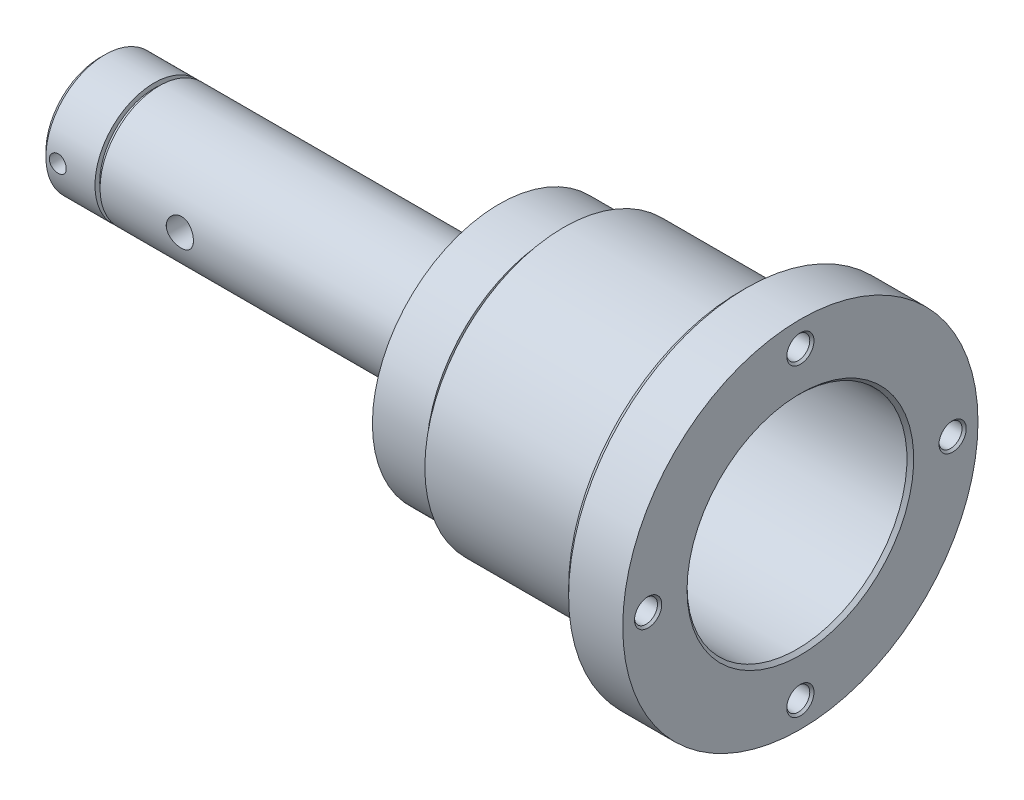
ISO-10303-21;
HEADER;
FILE_DESCRIPTION(('STEP AP214'),'2;1');
FILE_NAME('part.step','',(''),(''),'','','');
FILE_SCHEMA(('AUTOMOTIVE_DESIGN { 1 0 10303 214 1 1 1 1 }'));
ENDSEC;
DATA;
#1=APPLICATION_CONTEXT('core data for automotive mechanical design processes');
#2=APPLICATION_PROTOCOL_DEFINITION('international standard','automotive_design',2000,#1);
#3=PRODUCT_CONTEXT('',#1,'mechanical');
#4=PRODUCT('Part','Part','',(#3));
#5=PRODUCT_RELATED_PRODUCT_CATEGORY('part','',(#4));
#6=PRODUCT_DEFINITION_FORMATION('','',#4);
#7=PRODUCT_DEFINITION_CONTEXT('part definition',#1,'design');
#8=PRODUCT_DEFINITION('design','',#6,#7);
#9=PRODUCT_DEFINITION_SHAPE('','',#8);
#10=(LENGTH_UNIT() NAMED_UNIT(*) SI_UNIT(.MILLI.,.METRE.));
#11=(NAMED_UNIT(*) PLANE_ANGLE_UNIT() SI_UNIT($,.RADIAN.));
#12=(NAMED_UNIT(*) SI_UNIT($,.STERADIAN.) SOLID_ANGLE_UNIT());
#13=UNCERTAINTY_MEASURE_WITH_UNIT(LENGTH_MEASURE(1.E-05),#10,'distance_accuracy_value','');
#14=(GEOMETRIC_REPRESENTATION_CONTEXT(3) GLOBAL_UNCERTAINTY_ASSIGNED_CONTEXT((#13)) GLOBAL_UNIT_ASSIGNED_CONTEXT((#10,
#11,#12)) REPRESENTATION_CONTEXT('',''));
#15=CARTESIAN_POINT('',(0.,0.,0.));
#16=DIRECTION('',(0.,0.,1.));
#17=DIRECTION('',(1.,0.,0.));
#18=AXIS2_PLACEMENT_3D('',#15,#16,#17);
#19=CARTESIAN_POINT('',(33.,-291542.25,400000.));
#20=DIRECTION('',(1.,0.,0.));
#21=DIRECTION('',(0.,0.,-1.));
#22=AXIS2_PLACEMENT_3D('',#19,#20,#21);
#23=PLANE('',#22);
#24=CARTESIAN_POINT('',(33.,0.,0.));
#25=DIRECTION('',(1.,0.,0.));
#26=DIRECTION('',(0.,0.,-1.));
#27=AXIS2_PLACEMENT_3D('',#24,#25,#26);
#28=CIRCLE('',#27,3.39999999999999);
#29=CARTESIAN_POINT('',(33.,0.,-3.39999999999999));
#30=VERTEX_POINT('',#29);
#31=EDGE_CURVE('E276',#30,#30,#28,.F.);
#32=ORIENTED_EDGE('',*,*,#31,.F.);
#33=EDGE_LOOP('',(#32));
#34=FACE_BOUND('',#33,.T.);
#35=CARTESIAN_POINT('',(33.,0.,0.));
#36=DIRECTION('',(1.,0.,0.));
#37=DIRECTION('',(0.,0.,-1.));
#38=AXIS2_PLACEMENT_3D('',#35,#36,#37);
#39=CIRCLE('',#38,2.49999999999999);
#40=CARTESIAN_POINT('',(33.,0.,-2.49999999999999));
#41=VERTEX_POINT('',#40);
#42=EDGE_CURVE('E291',#41,#41,#39,.F.);
#43=ORIENTED_EDGE('',*,*,#42,.T.);
#44=EDGE_LOOP('',(#43));
#45=FACE_BOUND('',#44,.T.);
#46=ADVANCED_FACE('F60',(#34,#45),#23,.T.);
#47=CARTESIAN_POINT('',(207.,1.09436269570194E-13,0.));
#48=DIRECTION('',(-1.,0.,0.));
#49=DIRECTION('',(0.,0.,1.));
#50=AXIS2_PLACEMENT_3D('',#47,#48,#49);
#51=PLANE('',#50);
#52=CARTESIAN_POINT('',(207.,0.,0.));
#53=DIRECTION('',(-1.,0.,0.));
#54=DIRECTION('',(0.,0.,1.));
#55=AXIS2_PLACEMENT_3D('',#52,#53,#54);
#56=CIRCLE('',#55,33.5);
#57=CARTESIAN_POINT('',(207.,0.,33.5));
#58=VERTEX_POINT('',#57);
#59=EDGE_CURVE('E188',#58,#58,#56,.T.);
#60=ORIENTED_EDGE('',*,*,#59,.T.);
#61=EDGE_LOOP('',(#60));
#62=FACE_BOUND('',#61,.T.);
#63=CARTESIAN_POINT('',(207.,4.71349980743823E-13,45.));
#64=DIRECTION('',(1.,0.,0.));
#65=DIRECTION('',(0.,0.,-1.));
#66=AXIS2_PLACEMENT_3D('',#63,#64,#65);
#67=CIRCLE('',#66,4.025);
#68=CARTESIAN_POINT('',(207.,4.71349980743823E-13,40.975));
#69=VERTEX_POINT('',#68);
#70=EDGE_CURVE('E258',#69,#69,#67,.T.);
#71=ORIENTED_EDGE('',*,*,#70,.F.);
#72=EDGE_LOOP('',(#71));
#73=FACE_BOUND('',#72,.T.);
#74=CARTESIAN_POINT('',(207.,-45.,0.));
#75=DIRECTION('',(1.,0.,0.));
#76=DIRECTION('',(0.,0.,-1.));
#77=AXIS2_PLACEMENT_3D('',#74,#75,#76);
#78=CIRCLE('',#77,4.025);
#79=CARTESIAN_POINT('',(207.,-45.,-4.025));
#80=VERTEX_POINT('',#79);
#81=EDGE_CURVE('E199',#80,#80,#78,.T.);
#82=ORIENTED_EDGE('',*,*,#81,.F.);
#83=EDGE_LOOP('',(#82));
#84=FACE_BOUND('',#83,.T.);
#85=CARTESIAN_POINT('',(207.,-1.57116660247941E-13,-45.));
#86=DIRECTION('',(1.,0.,0.));
#87=DIRECTION('',(0.,0.,-1.));
#88=AXIS2_PLACEMENT_3D('',#85,#86,#87);
#89=CIRCLE('',#88,4.025);
#90=CARTESIAN_POINT('',(207.,-1.57116660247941E-13,-49.025));
#91=VERTEX_POINT('',#90);
#92=EDGE_CURVE('E201',#91,#91,#89,.T.);
#93=ORIENTED_EDGE('',*,*,#92,.F.);
#94=EDGE_LOOP('',(#93));
#95=FACE_BOUND('',#94,.T.);
#96=CARTESIAN_POINT('',(207.,45.,0.));
#97=DIRECTION('',(1.,0.,0.));
#98=DIRECTION('',(0.,0.,-1.));
#99=AXIS2_PLACEMENT_3D('',#96,#97,#98);
#100=CIRCLE('',#99,4.025);
#101=CARTESIAN_POINT('',(207.,45.,-4.025));
#102=VERTEX_POINT('',#101);
#103=EDGE_CURVE('E210',#102,#102,#100,.T.);
#104=ORIENTED_EDGE('',*,*,#103,.F.);
#105=EDGE_LOOP('',(#104));
#106=FACE_BOUND('',#105,.T.);
#107=CARTESIAN_POINT('',(207.,0.,0.));
#108=DIRECTION('',(-1.,0.,0.));
#109=DIRECTION('',(0.,0.,1.));
#110=AXIS2_PLACEMENT_3D('',#107,#108,#109);
#111=CIRCLE('',#110,52.5);
#112=CARTESIAN_POINT('',(207.,0.,52.5));
#113=VERTEX_POINT('',#112);
#114=EDGE_CURVE('E216',#113,#113,#111,.T.);
#115=ORIENTED_EDGE('',*,*,#114,.F.);
#116=EDGE_LOOP('',(#115));
#117=FACE_BOUND('',#116,.T.);
#118=ADVANCED_FACE('F399',(#62,#73,#84,#95,#106,#117),#51,.F.);
#119=CARTESIAN_POINT('',(6.12871751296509E-12,0.,0.));
#120=DIRECTION('',(-1.,0.,0.));
#121=DIRECTION('',(0.,0.,1.));
#122=AXIS2_PLACEMENT_3D('',#119,#120,#121);
#123=CYLINDRICAL_SURFACE('',#122,52.5);
#124=CARTESIAN_POINT('',(191.,0.,0.));
#125=DIRECTION('',(-1.,0.,0.));
#126=DIRECTION('',(0.,0.,1.));
#127=AXIS2_PLACEMENT_3D('',#124,#125,#126);
#128=CIRCLE('',#127,52.5);
#129=CARTESIAN_POINT('',(191.,0.,52.5));
#130=VERTEX_POINT('',#129);
#131=EDGE_CURVE('E195',#130,#130,#128,.F.);
#132=ORIENTED_EDGE('',*,*,#131,.T.);
#133=EDGE_LOOP('',(#132));
#134=FACE_BOUND('',#133,.T.);
#135=ORIENTED_EDGE('',*,*,#114,.T.);
#136=EDGE_LOOP('',(#135));
#137=FACE_BOUND('',#136,.T.);
#138=ADVANCED_FACE('F405',(#134,#137),#123,.T.);
#139=CARTESIAN_POINT('',(189.,0.,0.));
#140=DIRECTION('',(-1.,0.,0.));
#141=DIRECTION('',(0.,0.,1.));
#142=AXIS2_PLACEMENT_3D('',#139,#140,#141);
#143=PLANE('',#142);
#144=CARTESIAN_POINT('',(189.,4.71349980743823E-13,45.));
#145=DIRECTION('',(-1.,0.,0.));
#146=DIRECTION('',(0.,0.,1.));
#147=AXIS2_PLACEMENT_3D('',#144,#145,#146);
#148=CIRCLE('',#147,3.39999999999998);
#149=CARTESIAN_POINT('',(189.,4.71349980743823E-13,48.4));
#150=VERTEX_POINT('',#149);
#151=EDGE_CURVE('E193',#150,#150,#148,.T.);
#152=ORIENTED_EDGE('',*,*,#151,.F.);
#153=EDGE_LOOP('',(#152));
#154=FACE_BOUND('',#153,.T.);
#155=CARTESIAN_POINT('',(189.,-45.,0.));
#156=DIRECTION('',(-1.,0.,0.));
#157=DIRECTION('',(0.,0.,1.));
#158=AXIS2_PLACEMENT_3D('',#155,#156,#157);
#159=CIRCLE('',#158,3.39999999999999);
#160=CARTESIAN_POINT('',(189.,-45.,3.39999999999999));
#161=VERTEX_POINT('',#160);
#162=EDGE_CURVE('E196',#161,#161,#159,.T.);
#163=ORIENTED_EDGE('',*,*,#162,.F.);
#164=EDGE_LOOP('',(#163));
#165=FACE_BOUND('',#164,.T.);
#166=CARTESIAN_POINT('',(189.,-1.57116660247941E-13,-45.));
#167=DIRECTION('',(-1.,0.,0.));
#168=DIRECTION('',(0.,0.,1.));
#169=AXIS2_PLACEMENT_3D('',#166,#167,#168);
#170=CIRCLE('',#169,3.39999999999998);
#171=CARTESIAN_POINT('',(189.,-1.57116660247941E-13,-41.6));
#172=VERTEX_POINT('',#171);
#173=EDGE_CURVE('E203',#172,#172,#170,.T.);
#174=ORIENTED_EDGE('',*,*,#173,.F.);
#175=EDGE_LOOP('',(#174));
#176=FACE_BOUND('',#175,.T.);
#177=CARTESIAN_POINT('',(189.,45.,0.));
#178=DIRECTION('',(-1.,0.,0.));
#179=DIRECTION('',(0.,0.,1.));
#180=AXIS2_PLACEMENT_3D('',#177,#178,#179);
#181=CIRCLE('',#180,3.39999999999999);
#182=CARTESIAN_POINT('',(189.,45.,3.39999999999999));
#183=VERTEX_POINT('',#182);
#184=EDGE_CURVE('E209',#183,#183,#181,.T.);
#185=ORIENTED_EDGE('',*,*,#184,.F.);
#186=EDGE_LOOP('',(#185));
#187=FACE_BOUND('',#186,.T.);
#188=CARTESIAN_POINT('',(189.,0.,0.));
#189=DIRECTION('',(-1.,0.,0.));
#190=DIRECTION('',(0.,0.,1.));
#191=AXIS2_PLACEMENT_3D('',#188,#189,#190);
#192=CIRCLE('',#191,50.5);
#193=CARTESIAN_POINT('',(189.,0.,50.5));
#194=VERTEX_POINT('',#193);
#195=EDGE_CURVE('E217',#194,#194,#192,.T.);
#196=ORIENTED_EDGE('',*,*,#195,.T.);
#197=EDGE_LOOP('',(#196));
#198=FACE_BOUND('',#197,.T.);
#199=CARTESIAN_POINT('',(189.,0.,0.));
#200=DIRECTION('',(-1.,0.,0.));
#201=DIRECTION('',(0.,0.,1.));
#202=AXIS2_PLACEMENT_3D('',#199,#200,#201);
#203=CIRCLE('',#202,41.);
#204=CARTESIAN_POINT('',(189.,0.,41.));
#205=VERTEX_POINT('',#204);
#206=EDGE_CURVE('E221',#205,#205,#203,.T.);
#207=ORIENTED_EDGE('',*,*,#206,.F.);
#208=EDGE_LOOP('',(#207));
#209=FACE_BOUND('',#208,.T.);
#210=ADVANCED_FACE('F595',(#154,#165,#176,#187,#198,#209),#143,.T.);
#211=CARTESIAN_POINT('',(6.12871751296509E-12,0.,0.));
#212=DIRECTION('',(-1.,0.,0.));
#213=DIRECTION('',(0.,0.,1.));
#214=AXIS2_PLACEMENT_3D('',#211,#212,#213);
#215=CYLINDRICAL_SURFACE('',#214,41.);
#216=CARTESIAN_POINT('',(137.,0.,0.));
#217=DIRECTION('',(-1.,0.,0.));
#218=DIRECTION('',(0.,0.,1.));
#219=AXIS2_PLACEMENT_3D('',#216,#217,#218);
#220=CIRCLE('',#219,41.);
#221=CARTESIAN_POINT('',(137.,0.,41.));
#222=VERTEX_POINT('',#221);
#223=EDGE_CURVE('E222',#222,#222,#220,.T.);
#224=ORIENTED_EDGE('',*,*,#223,.F.);
#225=EDGE_LOOP('',(#224));
#226=FACE_BOUND('',#225,.T.);
#227=ORIENTED_EDGE('',*,*,#206,.T.);
#228=EDGE_LOOP('',(#227));
#229=FACE_BOUND('',#228,.T.);
#230=ADVANCED_FACE('F600',(#226,#229),#215,.T.);
#231=CARTESIAN_POINT('',(137.,0.,0.));
#232=DIRECTION('',(-1.,0.,0.));
#233=DIRECTION('',(0.,0.,1.));
#234=AXIS2_PLACEMENT_3D('',#231,#232,#233);
#235=PLANE('',#234);
#236=ORIENTED_EDGE('',*,*,#223,.T.);
#237=EDGE_LOOP('',(#236));
#238=FACE_BOUND('',#237,.T.);
#239=CARTESIAN_POINT('',(137.,0.,0.));
#240=DIRECTION('',(-1.,0.,0.));
#241=DIRECTION('',(0.,0.,1.));
#242=AXIS2_PLACEMENT_3D('',#239,#240,#241);
#243=CIRCLE('',#242,36.5);
#244=CARTESIAN_POINT('',(137.,0.,36.5));
#245=VERTEX_POINT('',#244);
#246=EDGE_CURVE('E226',#245,#245,#243,.T.);
#247=ORIENTED_EDGE('',*,*,#246,.F.);
#248=EDGE_LOOP('',(#247));
#249=FACE_BOUND('',#248,.T.);
#250=ADVANCED_FACE('F657',(#238,#249),#235,.T.);
#251=CARTESIAN_POINT('',(6.12871751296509E-12,0.,0.));
#252=DIRECTION('',(-1.,0.,0.));
#253=DIRECTION('',(0.,0.,1.));
#254=AXIS2_PLACEMENT_3D('',#251,#252,#253);
#255=CYLINDRICAL_SURFACE('',#254,36.5);
#256=CARTESIAN_POINT('',(134.,0.,0.));
#257=DIRECTION('',(-1.,0.,0.));
#258=DIRECTION('',(0.,0.,1.));
#259=AXIS2_PLACEMENT_3D('',#256,#257,#258);
#260=CIRCLE('',#259,36.5);
#261=CARTESIAN_POINT('',(134.,0.,36.5));
#262=VERTEX_POINT('',#261);
#263=EDGE_CURVE('E233',#262,#262,#260,.T.);
#264=ORIENTED_EDGE('',*,*,#263,.F.);
#265=EDGE_LOOP('',(#264));
#266=FACE_BOUND('',#265,.T.);
#267=ORIENTED_EDGE('',*,*,#246,.T.);
#268=EDGE_LOOP('',(#267));
#269=FACE_BOUND('',#268,.T.);
#270=ADVANCED_FACE('F652',(#266,#269),#255,.T.);
#271=CARTESIAN_POINT('',(134.,0.,0.));
#272=DIRECTION('',(-1.,0.,0.));
#273=DIRECTION('',(0.,0.,1.));
#274=AXIS2_PLACEMENT_3D('',#271,#272,#273);
#275=PLANE('',#274);
#276=CARTESIAN_POINT('',(134.,0.,0.));
#277=DIRECTION('',(-1.,0.,0.));
#278=DIRECTION('',(0.,0.,1.));
#279=AXIS2_PLACEMENT_3D('',#276,#277,#278);
#280=CIRCLE('',#279,37.5);
#281=CARTESIAN_POINT('',(134.,0.,37.5));
#282=VERTEX_POINT('',#281);
#283=EDGE_CURVE('E234',#282,#282,#280,.T.);
#284=ORIENTED_EDGE('',*,*,#283,.F.);
#285=EDGE_LOOP('',(#284));
#286=FACE_BOUND('',#285,.T.);
#287=ORIENTED_EDGE('',*,*,#263,.T.);
#288=EDGE_LOOP('',(#287));
#289=FACE_BOUND('',#288,.T.);
#290=ADVANCED_FACE('F645',(#286,#289),#275,.F.);
#291=CARTESIAN_POINT('',(6.12871751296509E-12,0.,0.));
#292=DIRECTION('',(-1.,0.,0.));
#293=DIRECTION('',(0.,0.,1.));
#294=AXIS2_PLACEMENT_3D('',#291,#292,#293);
#295=CYLINDRICAL_SURFACE('',#294,37.5);
#296=CARTESIAN_POINT('',(118.,0.,0.));
#297=DIRECTION('',(-1.,0.,0.));
#298=DIRECTION('',(0.,0.,1.));
#299=AXIS2_PLACEMENT_3D('',#296,#297,#298);
#300=CIRCLE('',#299,37.5);
#301=CARTESIAN_POINT('',(118.,0.,37.5));
#302=VERTEX_POINT('',#301);
#303=EDGE_CURVE('E240',#302,#302,#300,.T.);
#304=ORIENTED_EDGE('',*,*,#303,.F.);
#305=EDGE_LOOP('',(#304));
#306=FACE_BOUND('',#305,.T.);
#307=ORIENTED_EDGE('',*,*,#283,.T.);
#308=EDGE_LOOP('',(#307));
#309=FACE_BOUND('',#308,.T.);
#310=ADVANCED_FACE('F637',(#306,#309),#295,.T.);
#311=CARTESIAN_POINT('',(118.,0.,0.));
#312=DIRECTION('',(1.,0.,0.));
#313=DIRECTION('',(0.,0.,-1.));
#314=AXIS2_PLACEMENT_3D('',#311,#312,#313);
#315=PLANE('',#314);
#316=CARTESIAN_POINT('',(118.,0.,0.));
#317=DIRECTION('',(-1.,0.,0.));
#318=DIRECTION('',(0.,0.,1.));
#319=AXIS2_PLACEMENT_3D('',#316,#317,#318);
#320=CIRCLE('',#319,19.);
#321=CARTESIAN_POINT('',(118.,0.,19.));
#322=VERTEX_POINT('',#321);
#323=EDGE_CURVE('E306',#322,#322,#320,.T.);
#324=ORIENTED_EDGE('',*,*,#323,.F.);
#325=EDGE_LOOP('',(#324));
#326=FACE_BOUND('',#325,.T.);
#327=ORIENTED_EDGE('',*,*,#303,.T.);
#328=EDGE_LOOP('',(#327));
#329=FACE_BOUND('',#328,.T.);
#330=ADVANCED_FACE('F624',(#326,#329),#315,.F.);
#331=CARTESIAN_POINT('',(189.,0.,0.));
#332=DIRECTION('',(1.,0.,0.));
#333=DIRECTION('',(0.,0.,-1.));
#334=AXIS2_PLACEMENT_3D('',#331,#332,#333);
#335=CONICAL_SURFACE('',#334,50.5,0.785398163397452);
#336=ORIENTED_EDGE('',*,*,#131,.F.);
#337=EDGE_LOOP('',(#336));
#338=FACE_BOUND('',#337,.T.);
#339=ORIENTED_EDGE('',*,*,#195,.F.);
#340=EDGE_LOOP('',(#339));
#341=FACE_BOUND('',#340,.T.);
#342=ADVANCED_FACE('F487',(#338,#341),#335,.T.);
#343=CARTESIAN_POINT('',(207.,45.,0.));
#344=DIRECTION('',(1.,0.,0.));
#345=DIRECTION('',(0.,0.,-1.));
#346=AXIS2_PLACEMENT_3D('',#343,#344,#345);
#347=CYLINDRICAL_SURFACE('',#346,3.39999999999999);
#348=ORIENTED_EDGE('',*,*,#184,.T.);
#349=EDGE_LOOP('',(#348));
#350=FACE_BOUND('',#349,.T.);
#351=CARTESIAN_POINT('',(206.375,45.,0.));
#352=DIRECTION('',(1.,0.,0.));
#353=DIRECTION('',(0.,0.,-1.));
#354=AXIS2_PLACEMENT_3D('',#351,#352,#353);
#355=CIRCLE('',#354,3.4);
#356=CARTESIAN_POINT('',(206.375,45.,-3.4));
#357=VERTEX_POINT('',#356);
#358=EDGE_CURVE('E215',#357,#357,#355,.T.);
#359=ORIENTED_EDGE('',*,*,#358,.T.);
#360=EDGE_LOOP('',(#359));
#361=FACE_BOUND('',#360,.T.);
#362=ADVANCED_FACE('F485',(#350,#361),#347,.F.);
#363=CARTESIAN_POINT('',(207.,45.,0.));
#364=DIRECTION('',(1.,0.,0.));
#365=DIRECTION('',(0.,0.,-1.));
#366=AXIS2_PLACEMENT_3D('',#363,#364,#365);
#367=CONICAL_SURFACE('',#366,4.025,0.785398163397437);
#368=ORIENTED_EDGE('',*,*,#358,.F.);
#369=EDGE_LOOP('',(#368));
#370=FACE_BOUND('',#369,.T.);
#371=ORIENTED_EDGE('',*,*,#103,.T.);
#372=EDGE_LOOP('',(#371));
#373=FACE_BOUND('',#372,.T.);
#374=ADVANCED_FACE('F476',(#370,#373),#367,.F.);
#375=CARTESIAN_POINT('',(207.,-1.57116660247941E-13,-45.));
#376=DIRECTION('',(1.,0.,0.));
#377=DIRECTION('',(0.,0.,-1.));
#378=AXIS2_PLACEMENT_3D('',#375,#376,#377);
#379=CYLINDRICAL_SURFACE('',#378,3.39999999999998);
#380=ORIENTED_EDGE('',*,*,#173,.T.);
#381=EDGE_LOOP('',(#380));
#382=FACE_BOUND('',#381,.T.);
#383=CARTESIAN_POINT('',(206.375,-1.57116660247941E-13,-45.));
#384=DIRECTION('',(1.,0.,0.));
#385=DIRECTION('',(0.,0.,-1.));
#386=AXIS2_PLACEMENT_3D('',#383,#384,#385);
#387=CIRCLE('',#386,3.4);
#388=CARTESIAN_POINT('',(206.375,-1.57116660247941E-13,-48.4));
#389=VERTEX_POINT('',#388);
#390=EDGE_CURVE('E206',#389,#389,#387,.T.);
#391=ORIENTED_EDGE('',*,*,#390,.T.);
#392=EDGE_LOOP('',(#391));
#393=FACE_BOUND('',#392,.T.);
#394=ADVANCED_FACE('F472',(#382,#393),#379,.F.);
#395=CARTESIAN_POINT('',(207.,-1.57116660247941E-13,-45.));
#396=DIRECTION('',(1.,0.,0.));
#397=DIRECTION('',(0.,0.,-1.));
#398=AXIS2_PLACEMENT_3D('',#395,#396,#397);
#399=CONICAL_SURFACE('',#398,4.025,0.78539816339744);
#400=ORIENTED_EDGE('',*,*,#390,.F.);
#401=EDGE_LOOP('',(#400));
#402=FACE_BOUND('',#401,.T.);
#403=ORIENTED_EDGE('',*,*,#92,.T.);
#404=EDGE_LOOP('',(#403));
#405=FACE_BOUND('',#404,.T.);
#406=ADVANCED_FACE('F474',(#402,#405),#399,.F.);
#407=CARTESIAN_POINT('',(207.,-45.,0.));
#408=DIRECTION('',(1.,0.,0.));
#409=DIRECTION('',(0.,0.,-1.));
#410=AXIS2_PLACEMENT_3D('',#407,#408,#409);
#411=CYLINDRICAL_SURFACE('',#410,3.39999999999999);
#412=ORIENTED_EDGE('',*,*,#162,.T.);
#413=EDGE_LOOP('',(#412));
#414=FACE_BOUND('',#413,.T.);
#415=CARTESIAN_POINT('',(206.375,-45.,0.));
#416=DIRECTION('',(1.,0.,0.));
#417=DIRECTION('',(0.,0.,-1.));
#418=AXIS2_PLACEMENT_3D('',#415,#416,#417);
#419=CIRCLE('',#418,3.4);
#420=CARTESIAN_POINT('',(206.375,-45.,-3.4));
#421=VERTEX_POINT('',#420);
#422=EDGE_CURVE('E205',#421,#421,#419,.T.);
#423=ORIENTED_EDGE('',*,*,#422,.T.);
#424=EDGE_LOOP('',(#423));
#425=FACE_BOUND('',#424,.T.);
#426=ADVANCED_FACE('F470',(#414,#425),#411,.F.);
#427=CARTESIAN_POINT('',(207.,-45.,0.));
#428=DIRECTION('',(1.,0.,0.));
#429=DIRECTION('',(0.,0.,-1.));
#430=AXIS2_PLACEMENT_3D('',#427,#428,#429);
#431=CONICAL_SURFACE('',#430,4.025,0.785398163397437);
#432=ORIENTED_EDGE('',*,*,#422,.F.);
#433=EDGE_LOOP('',(#432));
#434=FACE_BOUND('',#433,.T.);
#435=ORIENTED_EDGE('',*,*,#81,.T.);
#436=EDGE_LOOP('',(#435));
#437=FACE_BOUND('',#436,.T.);
#438=ADVANCED_FACE('F465',(#434,#437),#431,.F.);
#439=CARTESIAN_POINT('',(207.,4.71349980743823E-13,45.));
#440=DIRECTION('',(1.,0.,0.));
#441=DIRECTION('',(0.,0.,-1.));
#442=AXIS2_PLACEMENT_3D('',#439,#440,#441);
#443=CYLINDRICAL_SURFACE('',#442,3.39999999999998);
#444=ORIENTED_EDGE('',*,*,#151,.T.);
#445=EDGE_LOOP('',(#444));
#446=FACE_BOUND('',#445,.T.);
#447=CARTESIAN_POINT('',(206.375,4.71349980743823E-13,45.));
#448=DIRECTION('',(1.,0.,0.));
#449=DIRECTION('',(0.,0.,-1.));
#450=AXIS2_PLACEMENT_3D('',#447,#448,#449);
#451=CIRCLE('',#450,3.4);
#452=CARTESIAN_POINT('',(206.375,4.71349980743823E-13,41.6));
#453=VERTEX_POINT('',#452);
#454=EDGE_CURVE('E200',#453,#453,#451,.T.);
#455=ORIENTED_EDGE('',*,*,#454,.T.);
#456=EDGE_LOOP('',(#455));
#457=FACE_BOUND('',#456,.T.);
#458=ADVANCED_FACE('F456',(#446,#457),#443,.F.);
#459=CARTESIAN_POINT('',(207.,4.71349980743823E-13,45.));
#460=DIRECTION('',(1.,0.,0.));
#461=DIRECTION('',(0.,0.,-1.));
#462=AXIS2_PLACEMENT_3D('',#459,#460,#461);
#463=CONICAL_SURFACE('',#462,4.025,0.78539816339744);
#464=ORIENTED_EDGE('',*,*,#454,.F.);
#465=EDGE_LOOP('',(#464));
#466=FACE_BOUND('',#465,.T.);
#467=ORIENTED_EDGE('',*,*,#70,.T.);
#468=EDGE_LOOP('',(#467));
#469=FACE_BOUND('',#468,.T.);
#470=ADVANCED_FACE('F452',(#466,#469),#463,.F.);
#471=CARTESIAN_POINT('',(0.,0.,0.));
#472=DIRECTION('',(-1.,0.,0.));
#473=DIRECTION('',(0.,0.,1.));
#474=AXIS2_PLACEMENT_3D('',#471,#472,#473);
#475=CYLINDRICAL_SURFACE('',#474,32.5);
#476=CARTESIAN_POINT('',(206.,0.,0.));
#477=DIRECTION('',(-1.,0.,0.));
#478=DIRECTION('',(0.,0.,1.));
#479=AXIS2_PLACEMENT_3D('',#476,#477,#478);
#480=CIRCLE('',#479,32.5);
#481=CARTESIAN_POINT('',(206.,0.,32.5));
#482=VERTEX_POINT('',#481);
#483=EDGE_CURVE('E190',#482,#482,#480,.F.);
#484=ORIENTED_EDGE('',*,*,#483,.T.);
#485=EDGE_LOOP('',(#484));
#486=FACE_BOUND('',#485,.T.);
#487=CARTESIAN_POINT('',(128.,0.,0.));
#488=DIRECTION('',(-1.,0.,0.));
#489=DIRECTION('',(0.,0.,1.));
#490=AXIS2_PLACEMENT_3D('',#487,#488,#489);
#491=CIRCLE('',#490,32.5);
#492=CARTESIAN_POINT('',(128.,0.,32.5));
#493=VERTEX_POINT('',#492);
#494=EDGE_CURVE('E264',#493,#493,#491,.T.);
#495=ORIENTED_EDGE('',*,*,#494,.T.);
#496=EDGE_LOOP('',(#495));
#497=FACE_BOUND('',#496,.T.);
#498=ADVANCED_FACE('F454',(#486,#497),#475,.F.);
#499=CARTESIAN_POINT('',(125.,0.,0.));
#500=DIRECTION('',(-1.,0.,0.));
#501=DIRECTION('',(0.,0.,1.));
#502=AXIS2_PLACEMENT_3D('',#499,#500,#501);
#503=PLANE('',#502);
#504=CARTESIAN_POINT('',(125.,0.,0.));
#505=DIRECTION('',(-1.,0.,0.));
#506=DIRECTION('',(0.,0.,1.));
#507=AXIS2_PLACEMENT_3D('',#504,#505,#506);
#508=CIRCLE('',#507,8.65470053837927);
#509=CARTESIAN_POINT('',(125.,0.,8.65470053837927));
#510=VERTEX_POINT('',#509);
#511=EDGE_CURVE('E263',#510,#510,#508,.T.);
#512=ORIENTED_EDGE('',*,*,#511,.T.);
#513=EDGE_LOOP('',(#512));
#514=FACE_BOUND('',#513,.T.);
#515=CARTESIAN_POINT('',(125.,0.,0.));
#516=DIRECTION('',(-1.,0.,0.));
#517=DIRECTION('',(0.,0.,1.));
#518=AXIS2_PLACEMENT_3D('',#515,#516,#517);
#519=CIRCLE('',#518,33.25);
#520=CARTESIAN_POINT('',(125.,0.,33.25));
#521=VERTEX_POINT('',#520);
#522=EDGE_CURVE('E239',#521,#521,#519,.T.);
#523=ORIENTED_EDGE('',*,*,#522,.F.);
#524=EDGE_LOOP('',(#523));
#525=FACE_BOUND('',#524,.T.);
#526=ADVANCED_FACE('F453',(#514,#525),#503,.F.);
#527=CARTESIAN_POINT('',(0.,0.,0.));
#528=DIRECTION('',(-1.,0.,0.));
#529=DIRECTION('',(0.,0.,1.));
#530=AXIS2_PLACEMENT_3D('',#527,#528,#529);
#531=CYLINDRICAL_SURFACE('',#530,33.25);
#532=ORIENTED_EDGE('',*,*,#522,.T.);
#533=EDGE_LOOP('',(#532));
#534=FACE_BOUND('',#533,.T.);
#535=CARTESIAN_POINT('',(128.,0.,0.));
#536=DIRECTION('',(-1.,0.,0.));
#537=DIRECTION('',(0.,0.,1.));
#538=AXIS2_PLACEMENT_3D('',#535,#536,#537);
#539=CIRCLE('',#538,33.25);
#540=CARTESIAN_POINT('',(128.,0.,33.25));
#541=VERTEX_POINT('',#540);
#542=EDGE_CURVE('E211',#541,#541,#539,.T.);
#543=ORIENTED_EDGE('',*,*,#542,.F.);
#544=EDGE_LOOP('',(#543));
#545=FACE_BOUND('',#544,.T.);
#546=ADVANCED_FACE('F493',(#534,#545),#531,.F.);
#547=CARTESIAN_POINT('',(128.,0.,0.));
#548=DIRECTION('',(-1.,0.,0.));
#549=DIRECTION('',(0.,0.,1.));
#550=AXIS2_PLACEMENT_3D('',#547,#548,#549);
#551=PLANE('',#550);
#552=ORIENTED_EDGE('',*,*,#494,.F.);
#553=EDGE_LOOP('',(#552));
#554=FACE_BOUND('',#553,.T.);
#555=ORIENTED_EDGE('',*,*,#542,.T.);
#556=EDGE_LOOP('',(#555));
#557=FACE_BOUND('',#556,.T.);
#558=ADVANCED_FACE('F450',(#554,#557),#551,.T.);
#559=CARTESIAN_POINT('',(207.,0.,0.));
#560=DIRECTION('',(1.,0.,0.));
#561=DIRECTION('',(0.,0.,-1.));
#562=AXIS2_PLACEMENT_3D('',#559,#560,#561);
#563=CONICAL_SURFACE('',#562,33.5,0.785398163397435);
#564=ORIENTED_EDGE('',*,*,#483,.F.);
#565=EDGE_LOOP('',(#564));
#566=FACE_BOUND('',#565,.T.);
#567=ORIENTED_EDGE('',*,*,#59,.F.);
#568=EDGE_LOOP('',(#567));
#569=FACE_BOUND('',#568,.T.);
#570=ADVANCED_FACE('F439',(#566,#569),#563,.F.);
#571=CARTESIAN_POINT('',(123.,0.,0.));
#572=DIRECTION('',(1.,0.,0.));
#573=DIRECTION('',(0.,0.,-1.));
#574=AXIS2_PLACEMENT_3D('',#571,#572,#573);
#575=CONICAL_SURFACE('',#574,7.5,0.523598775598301);
#576=ORIENTED_EDGE('',*,*,#511,.F.);
#577=EDGE_LOOP('',(#576));
#578=FACE_BOUND('',#577,.T.);
#579=CARTESIAN_POINT('',(123.,0.,0.));
#580=DIRECTION('',(-1.,0.,0.));
#581=DIRECTION('',(0.,0.,1.));
#582=AXIS2_PLACEMENT_3D('',#579,#580,#581);
#583=CIRCLE('',#582,7.5);
#584=CARTESIAN_POINT('',(123.,0.,7.5));
#585=VERTEX_POINT('',#584);
#586=EDGE_CURVE('E270',#585,#585,#583,.T.);
#587=ORIENTED_EDGE('',*,*,#586,.T.);
#588=EDGE_LOOP('',(#587));
#589=FACE_BOUND('',#588,.T.);
#590=ADVANCED_FACE('F434',(#578,#589),#575,.F.);
#591=CARTESIAN_POINT('',(0.,0.,0.));
#592=DIRECTION('',(-1.,0.,0.));
#593=DIRECTION('',(0.,0.,1.));
#594=AXIS2_PLACEMENT_3D('',#591,#592,#593);
#595=CYLINDRICAL_SURFACE('',#594,7.5);
#596=CARTESIAN_POINT('',(105.,0.,0.));
#597=DIRECTION('',(-1.,0.,0.));
#598=DIRECTION('',(0.,0.,1.));
#599=AXIS2_PLACEMENT_3D('',#596,#597,#598);
#600=CIRCLE('',#599,7.5);
#601=CARTESIAN_POINT('',(105.,0.,7.5));
#602=VERTEX_POINT('',#601);
#603=EDGE_CURVE('E272',#602,#602,#600,.T.);
#604=ORIENTED_EDGE('',*,*,#603,.T.);
#605=EDGE_LOOP('',(#604));
#606=FACE_BOUND('',#605,.T.);
#607=ORIENTED_EDGE('',*,*,#586,.F.);
#608=EDGE_LOOP('',(#607));
#609=FACE_BOUND('',#608,.T.);
#610=ADVANCED_FACE('F430',(#606,#609),#595,.F.);
#611=CARTESIAN_POINT('',(105.,0.,0.));
#612=DIRECTION('',(1.,0.,0.));
#613=DIRECTION('',(0.,0.,-1.));
#614=AXIS2_PLACEMENT_3D('',#611,#612,#613);
#615=CONICAL_SURFACE('',#614,7.5,1.04719755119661);
#616=CARTESIAN_POINT('',(102.979274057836,0.,0.));
#617=DIRECTION('',(1.,0.,0.));
#618=DIRECTION('',(0.,0.,-1.));
#619=AXIS2_PLACEMENT_3D('',#616,#617,#618);
#620=CIRCLE('',#619,3.99999999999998);
#621=CARTESIAN_POINT('',(102.979274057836,0.,-3.99999999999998));
#622=VERTEX_POINT('',#621);
#623=EDGE_CURVE('E274',#622,#622,#620,.T.);
#624=ORIENTED_EDGE('',*,*,#623,.F.);
#625=EDGE_LOOP('',(#624));
#626=FACE_BOUND('',#625,.T.);
#627=ORIENTED_EDGE('',*,*,#603,.F.);
#628=EDGE_LOOP('',(#627));
#629=FACE_BOUND('',#628,.T.);
#630=ADVANCED_FACE('F423',(#626,#629),#615,.F.);
#631=CARTESIAN_POINT('',(102.979274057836,4.025,0.));
#632=DIRECTION('',(1.,0.,0.));
#633=DIRECTION('',(0.,0.,-1.));
#634=AXIS2_PLACEMENT_3D('',#631,#632,#633);
#635=PLANE('',#634);
#636=ORIENTED_EDGE('',*,*,#623,.T.);
#637=EDGE_LOOP('',(#636));
#638=FACE_BOUND('',#637,.T.);
#639=CARTESIAN_POINT('',(102.979274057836,0.,0.));
#640=DIRECTION('',(1.,0.,0.));
#641=DIRECTION('',(0.,0.,-1.));
#642=AXIS2_PLACEMENT_3D('',#639,#640,#641);
#643=CIRCLE('',#642,4.025);
#644=CARTESIAN_POINT('',(102.979274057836,0.,-4.025));
#645=VERTEX_POINT('',#644);
#646=EDGE_CURVE('E282',#645,#645,#643,.T.);
#647=ORIENTED_EDGE('',*,*,#646,.F.);
#648=EDGE_LOOP('',(#647));
#649=FACE_BOUND('',#648,.T.);
#650=ADVANCED_FACE('F335',(#638,#649),#635,.F.);
#651=CARTESIAN_POINT('',(102.979274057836,0.,0.));
#652=DIRECTION('',(1.,0.,0.));
#653=DIRECTION('',(0.,0.,-1.));
#654=AXIS2_PLACEMENT_3D('',#651,#652,#653);
#655=CYLINDRICAL_SURFACE('',#654,3.39999999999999);
#656=CARTESIAN_POINT('',(43.1905002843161,-3.3994372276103,0.0618589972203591));
#657=CARTESIAN_POINT('',(43.1904550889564,-3.39838345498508,0.120544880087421));
#658=CARTESIAN_POINT('',(43.1929516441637,-3.39578297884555,0.179173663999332));
#659=CARTESIAN_POINT('',(43.2026732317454,-3.38761470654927,0.295711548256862));
#660=CARTESIAN_POINT('',(43.2098884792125,-3.38205305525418,0.353621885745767));
#661=CARTESIAN_POINT('',(43.2285501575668,-3.36819085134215,0.467479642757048));
#662=CARTESIAN_POINT('',(43.2399296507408,-3.35993384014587,0.523443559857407));
#663=CARTESIAN_POINT('',(43.2663993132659,-3.34082720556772,0.63405434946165));
#664=CARTESIAN_POINT('',(43.2814916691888,-3.32997605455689,0.688700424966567));
#665=CARTESIAN_POINT('',(43.3217853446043,-3.3008064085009,0.819032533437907));
#666=CARTESIAN_POINT('',(43.3485741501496,-3.28126320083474,0.893954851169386));
#667=CARTESIAN_POINT('',(43.4068920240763,-3.2377547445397,1.04057481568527));
#668=CARTESIAN_POINT('',(43.4384231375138,-3.21378758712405,1.1122710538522));
#669=CARTESIAN_POINT('',(43.538623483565,-3.13533124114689,1.32381289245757));
#670=CARTESIAN_POINT('',(43.6124841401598,-3.07456700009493,1.4589103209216));
#671=CARTESIAN_POINT('',(43.7466022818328,-2.95529838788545,1.68467064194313));
#672=CARTESIAN_POINT('',(43.8055800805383,-2.90010398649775,1.77793451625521));
#673=CARTESIAN_POINT('',(43.9247511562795,-2.7814626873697,1.95834707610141));
#674=CARTESIAN_POINT('',(43.9849449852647,-2.71801196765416,2.04549290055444));
#675=CARTESIAN_POINT('',(44.104630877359,-2.58311239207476,2.21338965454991));
#676=CARTESIAN_POINT('',(44.1641243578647,-2.51168475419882,2.2941566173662));
#677=CARTESIAN_POINT('',(44.2811187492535,-2.36068189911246,2.44926442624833));
#678=CARTESIAN_POINT('',(44.3386194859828,-2.28110597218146,2.52360471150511));
#679=CARTESIAN_POINT('',(44.4816013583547,-2.06681172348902,2.70510402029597));
#680=CARTESIAN_POINT('',(44.5647062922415,-1.92618079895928,2.80731042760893));
#681=CARTESIAN_POINT('',(44.7173948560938,-1.62562996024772,2.99136533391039));
#682=CARTESIAN_POINT('',(44.7869974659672,-1.46573764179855,3.07324245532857));
#683=CARTESIAN_POINT('',(44.8965291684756,-1.15897873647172,3.19986886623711));
#684=CARTESIAN_POINT('',(44.9395378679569,-1.01488689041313,3.24863763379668));
#685=CARTESIAN_POINT('',(45.0098584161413,-0.717858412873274,3.32689228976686));
#686=CARTESIAN_POINT('',(45.0371800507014,-0.56492736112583,3.35639020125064));
#687=CARTESIAN_POINT('',(45.0740020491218,-0.25357252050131,3.39416964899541));
#688=CARTESIAN_POINT('',(45.0834202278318,-0.0951267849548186,3.40235340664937));
#689=CARTESIAN_POINT('',(45.0833184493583,0.221343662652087,3.39647511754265));
#690=CARTESIAN_POINT('',(45.0738000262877,0.379368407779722,3.38241487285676));
#691=CARTESIAN_POINT('',(45.0380917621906,0.678260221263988,3.33484279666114));
#692=CARTESIAN_POINT('',(45.0131878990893,0.819531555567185,3.30284757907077));
#693=CARTESIAN_POINT('',(44.9496899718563,1.09400080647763,3.22236459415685));
#694=CARTESIAN_POINT('',(44.9110936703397,1.22719739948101,3.17387413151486));
#695=CARTESIAN_POINT('',(44.8190062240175,1.49349155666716,3.0581380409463));
#696=CARTESIAN_POINT('',(44.7645773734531,1.6257454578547,2.98971099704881));
#697=CARTESIAN_POINT('',(44.6455655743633,1.87691875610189,2.83878310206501));
#698=CARTESIAN_POINT('',(44.5809748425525,1.9958278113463,2.75627145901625));
#699=CARTESIAN_POINT('',(44.4107041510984,2.27541421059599,2.53537511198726));
#700=CARTESIAN_POINT('',(44.3005269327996,2.42757948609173,2.38956824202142));
#701=CARTESIAN_POINT('',(44.1305380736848,2.63248739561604,2.15426832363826));
#702=CARTESIAN_POINT('',(44.0729931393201,2.69698349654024,2.07292817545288));
#703=CARTESIAN_POINT('',(43.95767130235,2.81820972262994,1.90484051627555));
#704=CARTESIAN_POINT('',(43.8998944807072,2.87494235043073,1.81809476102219));
#705=CARTESIAN_POINT('',(43.7545771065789,3.00926469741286,1.59061780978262));
#706=CARTESIAN_POINT('',(43.66785989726,3.08151455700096,1.44608800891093));
#707=CARTESIAN_POINT('',(43.5462105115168,3.17502750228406,1.21895856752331));
#708=CARTESIAN_POINT('',(43.5070930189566,3.20370451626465,1.14159222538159));
#709=CARTESIAN_POINT('',(43.4331372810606,3.25581808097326,0.983159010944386));
#710=CARTESIAN_POINT('',(43.398296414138,3.27925784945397,0.902094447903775));
#711=CARTESIAN_POINT('',(43.3257063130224,3.32627823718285,0.712674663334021));
#712=CARTESIAN_POINT('',(43.289915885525,3.34802808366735,0.603079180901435));
#713=CARTESIAN_POINT('',(43.2333030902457,3.38072326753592,0.378708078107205));
#714=CARTESIAN_POINT('',(43.212419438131,3.3917129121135,0.263955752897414));
#715=CARTESIAN_POINT('',(43.1974736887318,3.39829316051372,0.113292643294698));
#716=CARTESIAN_POINT('',(43.1948672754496,3.39927814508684,0.078345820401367));
#717=CARTESIAN_POINT('',(43.1913799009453,3.40016962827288,0.00831425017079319));
#718=CARTESIAN_POINT('',(43.1905008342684,3.40007494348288,-0.0267706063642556));
#719=CARTESIAN_POINT('',(43.1905002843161,3.3994372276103,-0.0618589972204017));
#720=B_SPLINE_CURVE_WITH_KNOTS('',3,(#656,#657,#658,#659,#660,#661,#662,#663,#664,#665,#666,
#667,#668,#669,#670,#671,#672,#673,#674,#675,#676,#677,#678,#679,#680,#681,#682,#683,#684,#685,
#686,#687,#688,#689,#690,#691,#692,#693,#694,#695,#696,#697,#698,#699,#700,#701,#702,#703,#704,
#705,#706,#707,#708,#709,#710,#711,#712,#713,#714,#715,#716,#717,#718,#719),.UNSPECIFIED.,.F.,
.F.,(4,2,2,2,2,2,2,2,2,2,2,2,2,2,2,2,2,2,2,2,2,2,2,2,2,2,2,2,2,2,2,4),(0.,0.17596666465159,
0.35156958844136,0.524465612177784,0.697463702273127,0.942848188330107,1.18833879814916,
1.6831815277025,2.05296360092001,2.42291746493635,2.79190971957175,3.1609341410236,
3.73674382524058,4.31173814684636,4.7840267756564,5.25602046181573,5.7301756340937,
6.20429239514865,6.64332005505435,7.08241948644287,7.55630233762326,8.0305499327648,
8.7398724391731,9.09566136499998,9.45133532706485,9.99959539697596,10.273288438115,
10.5468128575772,10.8976063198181,11.2469491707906,11.3520752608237,11.4573165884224),.UNSPECIFIED.);
#721=CARTESIAN_POINT('',(43.1905002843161,-3.3994372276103,0.0618589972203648));
#722=VERTEX_POINT('',#721);
#723=CARTESIAN_POINT('',(43.1905002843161,3.3994372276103,-0.0618589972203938));
#724=VERTEX_POINT('',#723);
#725=EDGE_CURVE('E313',#722,#724,#720,.T.);
#726=ORIENTED_EDGE('',*,*,#725,.T.);
#727=CARTESIAN_POINT('',(44.2578877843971,3.38485494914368,0.320557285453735));
#728=CARTESIAN_POINT('',(44.1483478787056,3.38893582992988,0.277550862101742));
#729=CARTESIAN_POINT('',(44.0384635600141,3.39209965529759,0.235325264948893));
#730=CARTESIAN_POINT('',(43.8178809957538,3.39681008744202,0.152881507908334));
#731=CARTESIAN_POINT('',(43.7071825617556,3.39835630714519,0.112663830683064));
#732=CARTESIAN_POINT('',(43.4841440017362,3.40005241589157,0.0344379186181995));
#733=CARTESIAN_POINT('',(43.3717978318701,3.40019274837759,-0.00355345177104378));
#734=CARTESIAN_POINT('',(43.1461160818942,3.39933719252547,-0.0764002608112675));
#735=CARTESIAN_POINT('',(43.0327805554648,3.39834136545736,-0.111255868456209));
#736=CARTESIAN_POINT('',(42.6959550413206,3.39420191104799,-0.2086196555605));
#737=CARTESIAN_POINT('',(42.4708032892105,3.38991496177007,-0.265684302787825));
#738=CARTESIAN_POINT('',(42.1300311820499,3.38356201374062,-0.334747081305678));
#739=CARTESIAN_POINT('',(42.0160772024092,3.38145985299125,-0.354997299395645));
#740=CARTESIAN_POINT('',(41.787195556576,3.37770924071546,-0.389067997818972));
#741=CARTESIAN_POINT('',(41.6722680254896,3.3760607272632,-0.402889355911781));
#742=CARTESIAN_POINT('',(41.4599905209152,3.37375698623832,-0.421709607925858));
#743=CARTESIAN_POINT('',(41.3627348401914,3.3729859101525,-0.4277580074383));
#744=CARTESIAN_POINT('',(41.168034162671,3.37212736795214,-0.434475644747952));
#745=CARTESIAN_POINT('',(41.0705891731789,3.37203987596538,-0.435145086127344));
#746=CARTESIAN_POINT('',(40.8757609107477,3.37256325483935,-0.431070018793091));
#747=CARTESIAN_POINT('',(40.7783777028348,3.37317451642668,-0.426322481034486));
#748=CARTESIAN_POINT('',(40.584016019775,3.37499779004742,-0.411633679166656));
#749=CARTESIAN_POINT('',(40.4870375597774,3.37620982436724,-0.401692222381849));
#750=CARTESIAN_POINT('',(40.1966709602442,3.38048362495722,-0.364635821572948));
#751=CARTESIAN_POINT('',(40.0041999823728,3.38418102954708,-0.330298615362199));
#752=CARTESIAN_POINT('',(39.622568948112,3.39127718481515,-0.246906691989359));
#753=CARTESIAN_POINT('',(39.4334100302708,3.39467583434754,-0.197847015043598));
#754=CARTESIAN_POINT('',(39.018411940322,3.39974348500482,-0.0778179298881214));
#755=CARTESIAN_POINT('',(38.7932805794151,3.40089433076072,-0.00440905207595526));
#756=CARTESIAN_POINT('',(38.4589662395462,3.39835170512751,0.112884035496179));
#757=CARTESIAN_POINT('',(38.3484187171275,3.39680365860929,0.153047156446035));
#758=CARTESIAN_POINT('',(38.1280850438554,3.39209262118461,0.235394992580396));
#759=CARTESIAN_POINT('',(38.0182990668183,3.38892927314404,0.277580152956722));
#760=CARTESIAN_POINT('',(37.9088512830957,3.38485494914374,0.320557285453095));
#761=B_SPLINE_CURVE_WITH_KNOTS('',3,(#727,#728,#729,#730,#731,#732,#733,#734,#735,#736,#737,
#738,#739,#740,#741,#742,#743,#744,#745,#746,#747,#748,#749,#750,#751,#752,#753,#754,#755,#756,
#757,#758,#759,#760),.UNSPECIFIED.,.F.,.F.,(4,2,2,2,2,2,2,2,2,2,2,2,2,2,2,2,4),(0.,
0.353249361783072,0.706583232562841,1.06231728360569,1.41803215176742,2.1140255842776,
2.4611567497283,2.80824050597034,3.10043883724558,3.39262610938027,3.68497684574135,
3.97733842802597,4.56310205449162,5.14906323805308,5.85901172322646,6.21187389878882,
6.56481412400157),.UNSPECIFIED.);
#762=CARTESIAN_POINT('',(38.976238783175,3.3994372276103,-0.0618589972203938));
#763=VERTEX_POINT('',#762);
#764=EDGE_CURVE('E71',#724,#763,#761,.T.);
#765=ORIENTED_EDGE('',*,*,#764,.T.);
#766=CARTESIAN_POINT('',(38.976238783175,3.3994372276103,-0.0618589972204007));
#767=CARTESIAN_POINT('',(38.9762839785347,3.40051924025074,-0.0031736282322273));
#768=CARTESIAN_POINT('',(38.9737874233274,3.40005349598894,0.0555109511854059));
#769=CARTESIAN_POINT('',(38.9640658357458,3.39613046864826,0.172268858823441));
#770=CARTESIAN_POINT('',(38.9568505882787,3.39267937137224,0.230343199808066));
#771=CARTESIAN_POINT('',(38.9381889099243,3.38296867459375,0.344629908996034));
#772=CARTESIAN_POINT('',(38.9268094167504,3.37675318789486,0.400857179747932));
#773=CARTESIAN_POINT('',(38.9003397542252,3.36168340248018,0.512089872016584));
#774=CARTESIAN_POINT('',(38.8852473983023,3.35282754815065,0.567094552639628));
#775=CARTESIAN_POINT('',(38.8449537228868,3.32841890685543,0.698401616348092));
#776=CARTESIAN_POINT('',(38.8181649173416,3.31161443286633,0.773985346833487));
#777=CARTESIAN_POINT('',(38.7598470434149,3.27346905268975,0.922091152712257));
#778=CARTESIAN_POINT('',(38.7283159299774,3.25212618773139,0.99461188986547));
#779=CARTESIAN_POINT('',(38.6281155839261,3.18141801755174,1.20886805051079));
#780=CARTESIAN_POINT('',(38.5542549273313,3.12560906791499,1.34608674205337));
#781=CARTESIAN_POINT('',(38.4201367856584,3.01463294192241,1.57603678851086));
#782=CARTESIAN_POINT('',(38.3611589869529,2.9628681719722,1.6712469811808));
#783=CARTESIAN_POINT('',(38.2419879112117,2.85086911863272,1.85585646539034));
#784=CARTESIAN_POINT('',(38.1817940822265,2.79063091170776,1.94525303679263));
#785=CARTESIAN_POINT('',(38.0621081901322,2.66192900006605,2.11794650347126));
#786=CARTESIAN_POINT('',(38.0026147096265,2.59348708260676,2.20125864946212));
#787=CARTESIAN_POINT('',(37.8856203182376,2.44822726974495,2.36175750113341));
#788=CARTESIAN_POINT('',(37.8281195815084,2.37140864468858,2.43894367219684));
#789=CARTESIAN_POINT('',(37.6851377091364,2.16385950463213,2.62811919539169));
#790=CARTESIAN_POINT('',(37.6020327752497,2.02704011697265,2.73537432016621));
#791=CARTESIAN_POINT('',(37.4493442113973,1.73338446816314,2.93024190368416));
#792=CARTESIAN_POINT('',(37.3797416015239,1.57657682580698,3.01788196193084));
#793=CARTESIAN_POINT('',(37.2702098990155,1.27462787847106,3.15558492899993));
#794=CARTESIAN_POINT('',(37.2272011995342,1.13240571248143,3.209563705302));
#795=CARTESIAN_POINT('',(37.1568806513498,0.838420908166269,3.2985729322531));
#796=CARTESIAN_POINT('',(37.1295590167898,0.686664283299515,3.33361519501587));
#797=CARTESIAN_POINT('',(37.0927370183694,0.376890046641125,3.38269722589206));
#798=CARTESIAN_POINT('',(37.0833188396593,0.218846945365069,3.39664007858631));
#799=CARTESIAN_POINT('',(37.0834206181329,-0.0976278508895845,3.40227938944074));
#800=CARTESIAN_POINT('',(37.0929390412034,-0.256059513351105,3.39397764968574));
#801=CARTESIAN_POINT('',(37.1286473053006,-0.556484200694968,3.35731123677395));
#802=CARTESIAN_POINT('',(37.1535511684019,-0.698826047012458,3.33047688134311));
#803=CARTESIAN_POINT('',(37.2170490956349,-0.97604169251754,3.26003281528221));
#804=CARTESIAN_POINT('',(37.2556453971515,-1.11091426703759,3.21642036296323));
#805=CARTESIAN_POINT('',(37.3477328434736,-1.38124279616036,3.11044910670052));
#806=CARTESIAN_POINT('',(37.402161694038,-1.51589862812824,3.04687897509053));
#807=CARTESIAN_POINT('',(37.5211734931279,-1.77239664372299,2.90518909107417));
#808=CARTESIAN_POINT('',(37.5857642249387,-1.89422888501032,2.82705817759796));
#809=CARTESIAN_POINT('',(37.7560349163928,-2.1816667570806,2.61647987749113));
#810=CARTESIAN_POINT('',(37.8662121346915,-2.33903598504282,2.47630555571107));
#811=CARTESIAN_POINT('',(38.0362009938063,-2.55236883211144,2.24861629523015));
#812=CARTESIAN_POINT('',(38.0937459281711,-2.61978152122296,2.16967646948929));
#813=CARTESIAN_POINT('',(38.2090677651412,-2.74704279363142,2.00611049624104));
#814=CARTESIAN_POINT('',(38.2668445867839,-2.80689381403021,1.92148619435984));
#815=CARTESIAN_POINT('',(38.4121619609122,-2.94940321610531,1.69904670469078));
#816=CARTESIAN_POINT('',(38.4988791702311,-3.02686347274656,1.55724115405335));
#817=CARTESIAN_POINT('',(38.6205285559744,-3.12857784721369,1.33366423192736));
#818=CARTESIAN_POINT('',(38.6596460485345,-3.16005058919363,1.25739242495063));
#819=CARTESIAN_POINT('',(38.7336017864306,-3.21789371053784,1.10096007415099));
#820=CARTESIAN_POINT('',(38.7684426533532,-3.24426722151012,1.02080195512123));
#821=CARTESIAN_POINT('',(38.8410327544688,-3.29814787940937,0.833218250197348));
#822=CARTESIAN_POINT('',(38.8768231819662,-3.32387058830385,0.724486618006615));
#823=CARTESIAN_POINT('',(38.9334359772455,-3.36470711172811,0.501453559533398));
#824=CARTESIAN_POINT('',(38.9543196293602,-3.37986435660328,0.387177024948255));
#825=CARTESIAN_POINT('',(38.9692653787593,-3.39192161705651,0.236853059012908));
#826=CARTESIAN_POINT('',(38.9718717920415,-3.39417737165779,0.201965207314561));
#827=CARTESIAN_POINT('',(38.9753591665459,-3.39761612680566,0.132012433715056));
#828=CARTESIAN_POINT('',(38.9762382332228,-3.39879794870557,0.0969473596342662));
#829=CARTESIAN_POINT('',(38.976238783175,-3.3994372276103,0.0618589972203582));
#830=B_SPLINE_CURVE_WITH_KNOTS('',3,(#766,#767,#768,#769,#770,#771,#772,#773,#774,#775,#776,
#777,#778,#779,#780,#781,#782,#783,#784,#785,#786,#787,#788,#789,#790,#791,#792,#793,#794,#795,
#796,#797,#798,#799,#800,#801,#802,#803,#804,#805,#806,#807,#808,#809,#810,#811,#812,#813,#814,
#815,#816,#817,#818,#819,#820,#821,#822,#823,#824,#825,#826,#827,#828,#829),.UNSPECIFIED.,.F.,
.F.,(4,2,2,2,2,2,2,2,2,2,2,2,2,2,2,2,2,2,2,2,2,2,2,2,2,2,2,2,2,2,2,4),(0.,0.17596666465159,
0.351569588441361,0.524465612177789,0.697463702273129,0.942848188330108,1.18833879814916,
1.68318152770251,2.05296360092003,2.42291746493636,2.79190971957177,3.16093414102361,
3.73674382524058,4.31173814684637,4.78402677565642,5.25602046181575,5.73017563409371,
6.20429239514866,6.64332005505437,7.08241948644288,7.55630233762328,8.03054993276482,
8.73987243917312,9.095661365,9.45133532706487,9.99959539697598,10.273288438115,10.5468128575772,
10.8976063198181,11.2469491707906,11.3520752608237,11.4573165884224),.UNSPECIFIED.);
#831=CARTESIAN_POINT('',(38.976238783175,-3.3994372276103,0.061858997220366));
#832=VERTEX_POINT('',#831);
#833=EDGE_CURVE('E324',#763,#832,#830,.T.);
#834=ORIENTED_EDGE('',*,*,#833,.T.);
#835=CARTESIAN_POINT('',(38.2302902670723,-3.38485494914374,0.320557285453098));
#836=CARTESIAN_POINT('',(38.3530395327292,-3.38920549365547,0.274783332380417));
#837=CARTESIAN_POINT('',(38.4762676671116,-3.39248027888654,0.230145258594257));
#838=CARTESIAN_POINT('',(38.7239102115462,-3.39722233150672,0.143938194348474));
#839=CARTESIAN_POINT('',(38.8483253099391,-3.39868847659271,0.102371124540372));
#840=CARTESIAN_POINT('',(39.0998178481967,-3.40016089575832,0.0227190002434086));
#841=CARTESIAN_POINT('',(39.2269095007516,-3.40015064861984,-0.0153218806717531));
#842=CARTESIAN_POINT('',(39.4825155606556,-3.39909074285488,-0.0862482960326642));
#843=CARTESIAN_POINT('',(39.6110297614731,-3.39804123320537,-0.119134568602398));
#844=CARTESIAN_POINT('',(39.8632430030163,-3.39550937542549,-0.176959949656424));
#845=CARTESIAN_POINT('',(39.9868702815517,-3.39405069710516,-0.202208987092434));
#846=CARTESIAN_POINT('',(40.2353664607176,-3.39119100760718,-0.245557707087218));
#847=CARTESIAN_POINT('',(40.3602350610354,-3.38978998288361,-0.263659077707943));
#848=CARTESIAN_POINT('',(40.6102362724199,-3.38751115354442,-0.291488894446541));
#849=CARTESIAN_POINT('',(40.7353637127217,-3.38663053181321,-0.301262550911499));
#850=CARTESIAN_POINT('',(40.9859995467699,-3.38567095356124,-0.311870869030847));
#851=CARTESIAN_POINT('',(41.1115079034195,-3.38559192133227,-0.312706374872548));
#852=CARTESIAN_POINT('',(41.3500681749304,-3.38622695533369,-0.305735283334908));
#853=CARTESIAN_POINT('',(41.4631457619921,-3.38686472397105,-0.298760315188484));
#854=CARTESIAN_POINT('',(41.6886479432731,-3.38863818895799,-0.277920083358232));
#855=CARTESIAN_POINT('',(41.8010725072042,-3.38977390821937,-0.264054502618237));
#856=CARTESIAN_POINT('',(42.1380079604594,-3.39348654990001,-0.213087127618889));
#857=CARTESIAN_POINT('',(42.3611208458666,-3.39636112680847,-0.166657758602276));
#858=CARTESIAN_POINT('',(42.6974994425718,-3.39911825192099,-0.08264249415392));
#859=CARTESIAN_POINT('',(42.8124641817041,-3.39977378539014,-0.0513793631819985));
#860=CARTESIAN_POINT('',(43.0412970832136,-3.40012899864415,0.0150180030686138));
#861=CARTESIAN_POINT('',(43.1551651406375,-3.39982858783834,0.0501526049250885));
#862=CARTESIAN_POINT('',(43.380790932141,-3.39796259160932,0.123154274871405));
#863=CARTESIAN_POINT('',(43.492558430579,-3.39640919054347,0.160991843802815));
#864=CARTESIAN_POINT('',(43.7151618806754,-3.39181074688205,0.239095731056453));
#865=CARTESIAN_POINT('',(43.8259981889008,-3.38876630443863,0.27936106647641));
#866=CARTESIAN_POINT('',(43.9364488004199,-3.3848549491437,0.32055728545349));
#867=B_SPLINE_CURVE_WITH_KNOTS('',3,(#835,#836,#837,#838,#839,#840,#841,#842,#843,#844,#845,
#846,#847,#848,#849,#850,#851,#852,#853,#854,#855,#856,#857,#858,#859,#860,#861,#862,#863,#864,
#865,#866),.UNSPECIFIED.,.F.,.F.,(4,2,2,2,2,2,2,2,2,2,2,2,2,2,2,4),(0.,0.393249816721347,
0.786743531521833,1.18464088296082,1.58248120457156,1.9608712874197,2.33917195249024,
2.71540553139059,3.09160357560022,3.43125688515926,3.77092582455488,4.45342661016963,
4.81081628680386,5.16823983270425,5.52222902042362,5.87607584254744),.UNSPECIFIED.);
#868=EDGE_CURVE('E129',#832,#722,#867,.T.);
#869=ORIENTED_EDGE('',*,*,#868,.T.);
#870=EDGE_LOOP('',(#726,#765,#834,#869));
#871=FACE_BOUND('',#870,.T.);
#872=ORIENTED_EDGE('',*,*,#31,.T.);
#873=EDGE_LOOP('',(#872));
#874=FACE_BOUND('',#873,.T.);
#875=CARTESIAN_POINT('',(102.354274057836,0.,0.));
#876=DIRECTION('',(1.,0.,0.));
#877=DIRECTION('',(0.,0.,-1.));
#878=AXIS2_PLACEMENT_3D('',#875,#876,#877);
#879=CIRCLE('',#878,3.39999999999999);
#880=CARTESIAN_POINT('',(102.354274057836,0.,-3.39999999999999));
#881=VERTEX_POINT('',#880);
#882=EDGE_CURVE('E280',#881,#881,#879,.T.);
#883=ORIENTED_EDGE('',*,*,#882,.T.);
#884=EDGE_LOOP('',(#883));
#885=FACE_BOUND('',#884,.T.);
#886=ADVANCED_FACE('F329',(#871,#874,#885),#655,.F.);
#887=CARTESIAN_POINT('',(102.979274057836,0.,0.));
#888=DIRECTION('',(1.,0.,0.));
#889=DIRECTION('',(0.,0.,-1.));
#890=AXIS2_PLACEMENT_3D('',#887,#888,#889);
#891=CONICAL_SURFACE('',#890,4.025,0.785398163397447);
#892=ORIENTED_EDGE('',*,*,#882,.F.);
#893=EDGE_LOOP('',(#892));
#894=FACE_BOUND('',#893,.T.);
#895=ORIENTED_EDGE('',*,*,#646,.T.);
#896=EDGE_LOOP('',(#895));
#897=FACE_BOUND('',#896,.T.);
#898=ADVANCED_FACE('F331',(#894,#897),#891,.F.);
#899=CARTESIAN_POINT('',(23.,2.525,0.));
#900=DIRECTION('',(-1.,0.,0.));
#901=DIRECTION('',(0.,0.,1.));
#902=AXIS2_PLACEMENT_3D('',#899,#900,#901);
#903=PLANE('',#902);
#904=CARTESIAN_POINT('',(23.,0.,0.));
#905=DIRECTION('',(-1.,0.,0.));
#906=DIRECTION('',(0.,0.,1.));
#907=AXIS2_PLACEMENT_3D('',#904,#905,#906);
#908=CIRCLE('',#907,2.525);
#909=CARTESIAN_POINT('',(23.,0.,2.525));
#910=VERTEX_POINT('',#909);
#911=EDGE_CURVE('E180',#910,#910,#908,.T.);
#912=ORIENTED_EDGE('',*,*,#911,.F.);
#913=EDGE_LOOP('',(#912));
#914=FACE_BOUND('',#913,.T.);
#915=ADVANCED_FACE('F380',(#914),#903,.F.);
#916=CARTESIAN_POINT('',(23.,0.,0.));
#917=DIRECTION('',(-1.,0.,0.));
#918=DIRECTION('',(0.,0.,1.));
#919=AXIS2_PLACEMENT_3D('',#916,#917,#918);
#920=CYLINDRICAL_SURFACE('',#919,2.49999999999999);
#921=ORIENTED_EDGE('',*,*,#42,.F.);
#922=EDGE_LOOP('',(#921));
#923=FACE_BOUND('',#922,.T.);
#924=CARTESIAN_POINT('',(23.025,0.,0.));
#925=DIRECTION('',(-1.,0.,0.));
#926=DIRECTION('',(0.,0.,1.));
#927=AXIS2_PLACEMENT_3D('',#924,#925,#926);
#928=CIRCLE('',#927,2.49999999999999);
#929=CARTESIAN_POINT('',(23.025,0.,2.49999999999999));
#930=VERTEX_POINT('',#929);
#931=EDGE_CURVE('E292',#930,#930,#928,.T.);
#932=ORIENTED_EDGE('',*,*,#931,.T.);
#933=EDGE_LOOP('',(#932));
#934=FACE_BOUND('',#933,.T.);
#935=ADVANCED_FACE('F379',(#923,#934),#920,.F.);
#936=CARTESIAN_POINT('',(23.,0.,0.));
#937=DIRECTION('',(-1.,0.,0.));
#938=DIRECTION('',(0.,0.,1.));
#939=AXIS2_PLACEMENT_3D('',#936,#937,#938);
#940=CONICAL_SURFACE('',#939,2.525,0.78539816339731);
#941=ORIENTED_EDGE('',*,*,#931,.F.);
#942=EDGE_LOOP('',(#941));
#943=FACE_BOUND('',#942,.T.);
#944=ORIENTED_EDGE('',*,*,#911,.T.);
#945=EDGE_LOOP('',(#944));
#946=FACE_BOUND('',#945,.T.);
#947=ADVANCED_FACE('F361',(#943,#946),#940,.F.);
#948=CARTESIAN_POINT('',(121.,0.,0.));
#949=DIRECTION('',(-1.,0.,0.));
#950=DIRECTION('',(0.,0.,1.));
#951=AXIS2_PLACEMENT_3D('',#948,#949,#950);
#952=CYLINDRICAL_SURFACE('',#951,19.);
#953=CARTESIAN_POINT('',(121.,0.,0.));
#954=DIRECTION('',(-1.,0.,0.));
#955=DIRECTION('',(0.,0.,1.));
#956=AXIS2_PLACEMENT_3D('',#953,#954,#955);
#957=CIRCLE('',#956,19.);
#958=CARTESIAN_POINT('',(121.,0.,19.));
#959=VERTEX_POINT('',#958);
#960=EDGE_CURVE('E304',#959,#959,#957,.T.);
#961=ORIENTED_EDGE('',*,*,#960,.F.);
#962=EDGE_LOOP('',(#961));
#963=FACE_BOUND('',#962,.T.);
#964=ORIENTED_EDGE('',*,*,#323,.T.);
#965=EDGE_LOOP('',(#964));
#966=FACE_BOUND('',#965,.T.);
#967=ADVANCED_FACE('F360',(#963,#966),#952,.F.);
#968=CARTESIAN_POINT('',(121.,0.,0.));
#969=DIRECTION('',(-1.,0.,0.));
#970=DIRECTION('',(0.,0.,1.));
#971=AXIS2_PLACEMENT_3D('',#968,#969,#970);
#972=PLANE('',#971);
#973=CARTESIAN_POINT('',(121.,0.,0.));
#974=DIRECTION('',(-1.,0.,0.));
#975=DIRECTION('',(0.,0.,1.));
#976=AXIS2_PLACEMENT_3D('',#973,#974,#975);
#977=CIRCLE('',#976,17.5);
#978=CARTESIAN_POINT('',(121.,0.,17.5));
#979=VERTEX_POINT('',#978);
#980=EDGE_CURVE('E307',#979,#979,#977,.T.);
#981=ORIENTED_EDGE('',*,*,#980,.F.);
#982=EDGE_LOOP('',(#981));
#983=FACE_BOUND('',#982,.T.);
#984=ORIENTED_EDGE('',*,*,#960,.T.);
#985=EDGE_LOOP('',(#984));
#986=FACE_BOUND('',#985,.T.);
#987=ADVANCED_FACE('F353',(#983,#986),#972,.T.);
#988=CARTESIAN_POINT('',(6.5,0.,0.));
#989=DIRECTION('',(-1.,0.,0.));
#990=DIRECTION('',(0.,0.,1.));
#991=AXIS2_PLACEMENT_3D('',#988,#989,#990);
#992=PLANE('',#991);
#993=CARTESIAN_POINT('',(6.5,0.,0.));
#994=DIRECTION('',(1.,0.,0.));
#995=DIRECTION('',(0.,0.,-1.));
#996=AXIS2_PLACEMENT_3D('',#993,#994,#995);
#997=CIRCLE('',#996,4.24722325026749);
#998=CARTESIAN_POINT('',(6.5,0.,4.24722325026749));
#999=VERTEX_POINT('',#998);
#1000=EDGE_CURVE('E281',#999,#999,#997,.T.);
#1001=ORIENTED_EDGE('',*,*,#1000,.F.);
#1002=EDGE_LOOP('',(#1001));
#1003=FACE_BOUND('',#1002,.T.);
#1004=ADVANCED_FACE('F356',(#1003),#992,.T.);
#1005=CARTESIAN_POINT('',(0.,0.,0.));
#1006=DIRECTION('',(-1.,0.,0.));
#1007=DIRECTION('',(0.,0.,1.));
#1008=AXIS2_PLACEMENT_3D('',#1005,#1006,#1007);
#1009=CONICAL_SURFACE('',#1008,8.,0.523598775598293);
#1010=ORIENTED_EDGE('',*,*,#1000,.T.);
#1011=CARTESIAN_POINT('',(6.16874884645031,-0.940226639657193,4.33774139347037));
#1012=CARTESIAN_POINT('',(6.11670847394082,-1.00489953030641,4.35446570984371));
#1013=CARTESIAN_POINT('',(6.05956016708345,-1.06489046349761,4.37399304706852));
#1014=CARTESIAN_POINT('',(5.93744963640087,-1.17384846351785,4.4190081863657));
#1015=CARTESIAN_POINT('',(5.87246841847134,-1.22278787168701,4.44451062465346));
#1016=CARTESIAN_POINT('',(5.73763950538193,-1.30852653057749,4.50114848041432));
#1017=CARTESIAN_POINT('',(5.66781370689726,-1.34537658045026,4.53225945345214));
#1018=CARTESIAN_POINT('',(5.52543555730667,-1.40710524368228,4.59950771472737));
#1019=CARTESIAN_POINT('',(5.4528837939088,-1.43198642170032,4.63564392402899));
#1020=CARTESIAN_POINT('',(5.30146862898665,-1.4716293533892,4.71487173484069));
#1021=CARTESIAN_POINT('',(5.22253938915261,-1.48549392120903,4.75828153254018));
#1022=CARTESIAN_POINT('',(5.06546254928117,-1.50064989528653,4.8485367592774));
#1023=CARTESIAN_POINT('',(4.98731538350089,-1.50193466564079,4.89538398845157));
#1024=CARTESIAN_POINT('',(4.82042532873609,-1.49192522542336,4.99909341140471));
#1025=CARTESIAN_POINT('',(4.73204494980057,-1.47853492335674,5.05633863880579));
#1026=CARTESIAN_POINT('',(4.55953649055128,-1.43662256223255,5.17184692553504));
#1027=CARTESIAN_POINT('',(4.47541380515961,-1.40808180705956,5.23011115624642));
#1028=CARTESIAN_POINT('',(4.30287312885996,-1.33190696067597,5.35279606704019));
#1029=CARTESIAN_POINT('',(4.21520324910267,-1.28235343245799,5.41709064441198));
#1030=CARTESIAN_POINT('',(4.04957411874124,-1.1648904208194,5.5413015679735));
#1031=CARTESIAN_POINT('',(3.97160220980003,-1.09700524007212,5.60122357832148));
#1032=CARTESIAN_POINT('',(3.8492141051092,-0.965046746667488,5.69681695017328));
#1033=CARTESIAN_POINT('',(3.80157612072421,-0.905427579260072,5.7345250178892));
#1034=CARTESIAN_POINT('',(3.71472909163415,-0.777207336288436,5.80389115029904));
#1035=CARTESIAN_POINT('',(3.67550718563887,-0.708620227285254,5.83555843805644));
#1036=CARTESIAN_POINT('',(3.6131312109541,-0.575393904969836,5.88623449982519));
#1037=CARTESIAN_POINT('',(3.58839444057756,-0.511966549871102,5.90646930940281));
#1038=CARTESIAN_POINT('',(3.54747801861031,-0.38065511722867,5.94005139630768));
#1039=CARTESIAN_POINT('',(3.53129370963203,-0.312773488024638,5.95340242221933));
#1040=CARTESIAN_POINT('',(3.50845957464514,-0.173990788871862,5.97226424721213));
#1041=CARTESIAN_POINT('',(3.50185581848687,-0.103076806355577,5.97773716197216));
#1042=CARTESIAN_POINT('',(3.49882609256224,0.0391158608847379,5.98024619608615));
#1043=CARTESIAN_POINT('',(3.50239827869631,0.110394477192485,5.97728384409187));
#1044=CARTESIAN_POINT('',(3.51874846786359,0.245223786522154,5.96376226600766));
#1045=CARTESIAN_POINT('',(3.53076224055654,0.308934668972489,5.95383379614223));
#1046=CARTESIAN_POINT('',(3.56244666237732,0.43306635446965,5.92775382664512));
#1047=CARTESIAN_POINT('',(3.58211824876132,0.493486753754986,5.91160156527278));
#1048=CARTESIAN_POINT('',(3.62958823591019,0.613506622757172,5.87283879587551));
#1049=CARTESIAN_POINT('',(3.65781191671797,0.672827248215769,5.8498922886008));
#1050=CARTESIAN_POINT('',(3.72063462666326,0.785753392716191,5.7992004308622));
#1051=CARTESIAN_POINT('',(3.75523854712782,0.839354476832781,5.77145139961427));
#1052=CARTESIAN_POINT('',(3.84677091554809,0.963549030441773,5.69872572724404));
#1053=CARTESIAN_POINT('',(3.90668165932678,1.03073753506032,5.65166532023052));
#1054=CARTESIAN_POINT('',(4.03511256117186,1.15187306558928,5.5525275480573));
#1055=CARTESIAN_POINT('',(4.10364560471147,1.20579990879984,5.50044270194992));
#1056=CARTESIAN_POINT('',(4.24832012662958,1.3009877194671,5.3928343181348));
#1057=CARTESIAN_POINT('',(4.32454990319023,1.34207256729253,5.33727453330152));
#1058=CARTESIAN_POINT('',(4.48236167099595,1.41047897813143,5.22529279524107));
#1059=CARTESIAN_POINT('',(4.56394533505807,1.43779621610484,5.16887057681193));
#1060=CARTESIAN_POINT('',(4.74455274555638,1.48145265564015,5.04799231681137));
#1061=CARTESIAN_POINT('',(4.84428345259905,1.49534768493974,4.98368937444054));
#1062=CARTESIAN_POINT('',(5.0469970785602,1.50268168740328,4.85911639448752));
#1063=CARTESIAN_POINT('',(5.14997718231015,1.49613791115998,4.79884299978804));
#1064=CARTESIAN_POINT('',(5.3335188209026,1.4647321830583,4.69763233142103));
#1065=CARTESIAN_POINT('',(5.4140729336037,1.4441751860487,4.65534441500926));
#1066=CARTESIAN_POINT('',(5.57299943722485,1.38878936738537,4.57636420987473));
#1067=CARTESIAN_POINT('',(5.65137363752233,1.35397278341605,4.53966715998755));
#1068=CARTESIAN_POINT('',(5.80354955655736,1.26961230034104,4.47272028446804));
#1069=CARTESIAN_POINT('',(5.87732118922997,1.21998173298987,4.44251025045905));
#1070=CARTESIAN_POINT('',(6.01634915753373,1.10682135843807,4.38931164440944));
#1071=CARTESIAN_POINT('',(6.08160824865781,1.04329606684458,4.36632073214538));
#1072=CARTESIAN_POINT('',(6.19416630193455,0.911425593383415,4.32926214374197));
#1073=CARTESIAN_POINT('',(6.2426234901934,0.844253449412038,4.31451866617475));
#1074=CARTESIAN_POINT('',(6.32808696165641,0.70217720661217,4.28991669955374));
#1075=CARTESIAN_POINT('',(6.36509478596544,0.627274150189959,4.28005755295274));
#1076=CARTESIAN_POINT('',(6.42532622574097,0.474341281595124,4.26467039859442));
#1077=CARTESIAN_POINT('',(6.44893049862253,0.396472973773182,4.25902118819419));
#1078=CARTESIAN_POINT('',(6.48325428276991,0.237792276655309,4.2509747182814));
#1079=CARTESIAN_POINT('',(6.49397484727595,0.156980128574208,4.24857719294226));
#1080=CARTESIAN_POINT('',(6.50222676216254,-0.00606147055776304,4.24672191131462));
#1081=CARTESIAN_POINT('',(6.49964127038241,-0.0882971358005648,4.24729019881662));
#1082=CARTESIAN_POINT('',(6.48108565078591,-0.251212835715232,4.25150494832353));
#1083=CARTESIAN_POINT('',(6.46510843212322,-0.331892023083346,4.25515304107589));
#1084=CARTESIAN_POINT('',(6.42022340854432,-0.489606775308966,4.26598958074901));
#1085=CARTESIAN_POINT('',(6.39127226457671,-0.566629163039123,4.27318990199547));
#1086=CARTESIAN_POINT('',(6.32148408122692,-0.714367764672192,4.29183272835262));
#1087=CARTESIAN_POINT('',(6.28067615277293,-0.785098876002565,4.3032648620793));
#1088=CARTESIAN_POINT('',(6.21380528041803,-0.882073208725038,4.32348895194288));
#1089=CARTESIAN_POINT('',(6.19177716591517,-0.911608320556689,4.33034073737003));
#1090=CARTESIAN_POINT('',(6.16874884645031,-0.940226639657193,4.33774139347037));
#1091=B_SPLINE_CURVE_WITH_KNOTS('',3,(#1011,#1012,#1013,#1014,#1015,#1016,#1017,#1018,#1019,
#1020,#1021,#1022,#1023,#1024,#1025,#1026,#1027,#1028,#1029,#1030,#1031,#1032,#1033,#1034,#1035,
#1036,#1037,#1038,#1039,#1040,#1041,#1042,#1043,#1044,#1045,#1046,#1047,#1048,#1049,#1050,#1051,
#1052,#1053,#1054,#1055,#1056,#1057,#1058,#1059,#1060,#1061,#1062,#1063,#1064,#1065,#1066,#1067,
#1068,#1069,#1070,#1071,#1072,#1073,#1074,#1075,#1076,#1077,#1078,#1079,#1080,#1081,#1082,#1083,
#1084,#1085,#1086,#1087,#1088,#1089,#1090),.UNSPECIFIED.,.T.,.F.,(4,2,2,2,2,2,2,2,2,2,2,2,2,2,2,
2,2,2,2,2,2,2,2,2,2,2,2,2,2,2,2,2,2,2,2,2,2,2,2,4),(0.,0.253918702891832,0.508466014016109,
0.761929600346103,1.0153388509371,1.28772218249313,1.56024918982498,1.87744093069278,
2.1950250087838,2.55174430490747,2.9079929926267,3.16244001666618,3.41649538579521,
3.62868636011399,3.84076166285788,4.05385342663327,4.26690657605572,4.46280865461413,
4.65873471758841,4.86670624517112,5.0748378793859,5.37792905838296,5.68147869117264,
5.98902513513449,6.2966681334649,6.65335234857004,7.00973559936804,7.28841709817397,
7.56685992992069,7.84696481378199,8.12697880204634,8.37810994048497,8.62920726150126,
8.87276214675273,9.11629712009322,9.36197423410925,9.60778151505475,9.85441610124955,
10.1004501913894,10.2128114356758),.UNSPECIFIED.);
#1092=EDGE_CURVE('E61',#999,#999,#1091,.T.);
#1093=ORIENTED_EDGE('',*,*,#1092,.F.);
#1094=EDGE_LOOP('',(#1010,#1093));
#1095=FACE_BOUND('',#1094,.T.);
#1096=CARTESIAN_POINT('',(0.,0.,0.));
#1097=DIRECTION('',(1.,0.,0.));
#1098=DIRECTION('',(0.,0.,-1.));
#1099=AXIS2_PLACEMENT_3D('',#1096,#1097,#1098);
#1100=CIRCLE('',#1099,8.);
#1101=CARTESIAN_POINT('',(0.,0.,-8.));
#1102=VERTEX_POINT('',#1101);
#1103=EDGE_CURVE('E288',#1102,#1102,#1100,.T.);
#1104=ORIENTED_EDGE('',*,*,#1103,.F.);
#1105=EDGE_LOOP('',(#1104));
#1106=FACE_BOUND('',#1105,.T.);
#1107=ADVANCED_FACE('F386',(#1095,#1106),#1009,.F.);
#1108=CARTESIAN_POINT('',(0.,0.,0.));
#1109=DIRECTION('',(1.,0.,0.));
#1110=DIRECTION('',(0.,0.,-1.));
#1111=AXIS2_PLACEMENT_3D('',#1108,#1109,#1110);
#1112=PLANE('',#1111);
#1113=ORIENTED_EDGE('',*,*,#1103,.T.);
#1114=EDGE_LOOP('',(#1113));
#1115=FACE_BOUND('',#1114,.T.);
#1116=CARTESIAN_POINT('',(0.,0.,0.));
#1117=DIRECTION('',(1.,0.,0.));
#1118=DIRECTION('',(0.,0.,-1.));
#1119=AXIS2_PLACEMENT_3D('',#1116,#1117,#1118);
#1120=CIRCLE('',#1119,16.);
#1121=CARTESIAN_POINT('',(0.,0.,-16.));
#1122=VERTEX_POINT('',#1121);
#1123=EDGE_CURVE('E183',#1122,#1122,#1120,.F.);
#1124=ORIENTED_EDGE('',*,*,#1123,.T.);
#1125=EDGE_LOOP('',(#1124));
#1126=FACE_BOUND('',#1125,.T.);
#1127=ADVANCED_FACE('F392',(#1115,#1126),#1112,.F.);
#1128=CARTESIAN_POINT('',(0.,0.,0.));
#1129=DIRECTION('',(1.,0.,0.));
#1130=DIRECTION('',(0.,0.,-1.));
#1131=AXIS2_PLACEMENT_3D('',#1128,#1129,#1130);
#1132=CONICAL_SURFACE('',#1131,16.,0.785398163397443);
#1133=CARTESIAN_POINT('',(1.50000000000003,0.,0.));
#1134=DIRECTION('',(1.,0.,0.));
#1135=DIRECTION('',(0.,0.,-1.));
#1136=AXIS2_PLACEMENT_3D('',#1133,#1134,#1135);
#1137=CIRCLE('',#1136,17.5);
#1138=CARTESIAN_POINT('',(1.50000000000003,0.,-17.5));
#1139=VERTEX_POINT('',#1138);
#1140=EDGE_CURVE('E169',#1139,#1139,#1137,.T.);
#1141=ORIENTED_EDGE('',*,*,#1140,.F.);
#1142=EDGE_LOOP('',(#1141));
#1143=FACE_BOUND('',#1142,.T.);
#1144=ORIENTED_EDGE('',*,*,#1123,.F.);
#1145=EDGE_LOOP('',(#1144));
#1146=FACE_BOUND('',#1145,.T.);
#1147=ADVANCED_FACE('F58',(#1143,#1146),#1132,.T.);
#1148=CARTESIAN_POINT('',(6.12871751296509E-12,0.,0.));
#1149=DIRECTION('',(-1.,0.,0.));
#1150=DIRECTION('',(0.,0.,1.));
#1151=AXIS2_PLACEMENT_3D('',#1148,#1149,#1150);
#1152=CYLINDRICAL_SURFACE('',#1151,17.5);
#1153=CARTESIAN_POINT('',(7.5,0.,17.5));
#1154=CARTESIAN_POINT('',(7.49999418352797,-0.139663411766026,17.4999978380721));
#1155=CARTESIAN_POINT('',(7.48825698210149,-0.279409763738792,17.4983105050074));
#1156=CARTESIAN_POINT('',(7.44162715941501,-0.555001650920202,17.4917417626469));
#1157=CARTESIAN_POINT('',(7.40671149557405,-0.690843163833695,17.4868571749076));
#1158=CARTESIAN_POINT('',(7.31478484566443,-0.954596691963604,17.4744432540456));
#1159=CARTESIAN_POINT('',(7.25779000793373,-1.08251442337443,17.4669158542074));
#1160=CARTESIAN_POINT('',(7.12336114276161,-1.32694912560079,17.4500497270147));
#1161=CARTESIAN_POINT('',(7.04593015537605,-1.44346778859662,17.4407112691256));
#1162=CARTESIAN_POINT('',(6.87223957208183,-1.66264662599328,17.4211884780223));
#1163=CARTESIAN_POINT('',(6.77586339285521,-1.76521397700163,17.4109991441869));
#1164=CARTESIAN_POINT('',(6.56726896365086,-1.95277822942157,17.3909624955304));
#1165=CARTESIAN_POINT('',(6.4550498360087,-2.03777415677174,17.3811151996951));
#1166=CARTESIAN_POINT('',(6.21733720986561,-2.18813969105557,17.3628289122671));
#1167=CARTESIAN_POINT('',(6.09178688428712,-2.25342031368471,17.3543963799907));
#1168=CARTESIAN_POINT('',(5.83136365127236,-2.36193362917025,17.3399620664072));
#1169=CARTESIAN_POINT('',(5.69649120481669,-2.40516741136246,17.3339601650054));
#1170=CARTESIAN_POINT('',(5.42222497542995,-2.46807330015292,17.3251154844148));
#1171=CARTESIAN_POINT('',(5.28286820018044,-2.48790372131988,17.3222514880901));
#1172=CARTESIAN_POINT('',(5.002777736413,-2.50393025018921,17.3199423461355));
#1173=CARTESIAN_POINT('',(4.8620441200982,-2.50012759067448,17.320497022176));
#1174=CARTESIAN_POINT('',(4.58430863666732,-2.46912545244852,17.3249431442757));
#1175=CARTESIAN_POINT('',(4.44728669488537,-2.44210170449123,17.328809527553));
#1176=CARTESIAN_POINT('',(4.17974228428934,-2.36569930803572,17.3394042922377));
#1177=CARTESIAN_POINT('',(4.04921998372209,-2.31632008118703,17.3461327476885));
#1178=CARTESIAN_POINT('',(3.79784181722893,-2.19642380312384,17.361721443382));
#1179=CARTESIAN_POINT('',(3.6770222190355,-2.12583173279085,17.3705892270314));
#1180=CARTESIAN_POINT('',(3.44887696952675,-1.96556711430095,17.3894518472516));
#1181=CARTESIAN_POINT('',(3.34155212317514,-1.87589342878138,17.3994467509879));
#1182=CARTESIAN_POINT('',(3.14242399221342,-1.67904364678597,17.4195483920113));
#1183=CARTESIAN_POINT('',(3.0507701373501,-1.57171634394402,17.4296553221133));
#1184=CARTESIAN_POINT('',(2.88675374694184,-1.34312289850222,17.4487579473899));
#1185=CARTESIAN_POINT('',(2.81439128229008,-1.22185670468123,17.4577536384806));
#1186=CARTESIAN_POINT('',(2.69100640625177,-0.968702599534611,17.4736283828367));
#1187=CARTESIAN_POINT('',(2.63999486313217,-0.836809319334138,17.4805063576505));
#1188=CARTESIAN_POINT('',(2.56088632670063,-0.566208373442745,17.4913614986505));
#1189=CARTESIAN_POINT('',(2.53278792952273,-0.427501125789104,17.4953388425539));
#1190=CARTESIAN_POINT('',(2.50050046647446,-0.148500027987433,17.4999211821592));
#1191=CARTESIAN_POINT('',(2.49610584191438,-0.00823042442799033,17.500555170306));
#1192=CARTESIAN_POINT('',(2.51080601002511,0.271043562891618,17.4984580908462));
#1193=CARTESIAN_POINT('',(2.52990014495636,0.410047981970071,17.4957271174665));
#1194=CARTESIAN_POINT('',(2.59086492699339,0.682228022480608,17.4872249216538));
#1195=CARTESIAN_POINT('',(2.63263607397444,0.815426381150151,17.4814669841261));
#1196=CARTESIAN_POINT('',(2.73766467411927,1.07292868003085,17.4675546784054));
#1197=CARTESIAN_POINT('',(2.80092305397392,1.19723223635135,17.4594002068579));
#1198=CARTESIAN_POINT('',(2.94761727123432,1.43432461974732,17.4415297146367));
#1199=CARTESIAN_POINT('',(3.03118428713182,1.54703151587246,17.4318036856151));
#1200=CARTESIAN_POINT('',(3.21594009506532,1.75689411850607,17.4119055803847));
#1201=CARTESIAN_POINT('',(3.31712981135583,1.85404900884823,17.4017334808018));
#1202=CARTESIAN_POINT('',(3.53517087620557,2.03079205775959,17.3819985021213));
#1203=CARTESIAN_POINT('',(3.65213408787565,2.11024287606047,17.3724407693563));
#1204=CARTESIAN_POINT('',(3.89786648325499,2.24836960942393,17.3551058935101));
#1205=CARTESIAN_POINT('',(4.02663537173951,2.30704604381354,17.3473287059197));
#1206=CARTESIAN_POINT('',(4.29190413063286,2.40174263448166,17.334472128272));
#1207=CARTESIAN_POINT('',(4.42837719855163,2.43783662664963,17.3293839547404));
#1208=CARTESIAN_POINT('',(4.70552570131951,2.48657966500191,17.3224576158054));
#1209=CARTESIAN_POINT('',(4.8462008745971,2.49923016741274,17.3206192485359));
#1210=CARTESIAN_POINT('',(5.12639228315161,2.50069487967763,17.3204077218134));
#1211=CARTESIAN_POINT('',(5.26590741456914,2.48972496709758,17.3220031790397));
#1212=CARTESIAN_POINT('',(5.54108765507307,2.444721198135,17.3284115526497));
#1213=CARTESIAN_POINT('',(5.67675276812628,2.41068736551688,17.3332244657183));
#1214=CARTESIAN_POINT('',(5.94033158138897,2.32059556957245,17.3455148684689));
#1215=CARTESIAN_POINT('',(6.0682500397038,2.26455128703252,17.3529907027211));
#1216=CARTESIAN_POINT('',(6.31290305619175,2.13205080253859,17.3697668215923));
#1217=CARTESIAN_POINT('',(6.42963730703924,2.05559403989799,17.3790671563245));
#1218=CARTESIAN_POINT('',(6.64970727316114,1.88364934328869,17.3985457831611));
#1219=CARTESIAN_POINT('',(6.75291718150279,1.78800116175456,17.4087310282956));
#1220=CARTESIAN_POINT('',(6.94189963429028,1.58072689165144,17.4287727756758));
#1221=CARTESIAN_POINT('',(7.02766810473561,1.46909708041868,17.4386292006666));
#1222=CARTESIAN_POINT('',(7.17970946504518,1.23237928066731,17.456958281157));
#1223=CARTESIAN_POINT('',(7.24588331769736,1.10722714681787,17.4654238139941));
#1224=CARTESIAN_POINT('',(7.35617468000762,0.847526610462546,17.479946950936));
#1225=CARTESIAN_POINT('',(7.40031537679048,0.712988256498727,17.4860070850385));
#1226=CARTESIAN_POINT('',(7.45510448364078,0.481514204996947,17.4936295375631));
#1227=CARTESIAN_POINT('',(7.4719150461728,0.386017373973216,17.4960063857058));
#1228=CARTESIAN_POINT('',(7.49436476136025,0.193693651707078,17.4991923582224));
#1229=CARTESIAN_POINT('',(7.50000403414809,0.0968667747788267,17.5000014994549));
#1230=CARTESIAN_POINT('',(7.5,0.,17.5));
#1231=B_SPLINE_CURVE_WITH_KNOTS('',3,(#1153,#1154,#1155,#1156,#1157,#1158,#1159,#1160,#1161,
#1162,#1163,#1164,#1165,#1166,#1167,#1168,#1169,#1170,#1171,#1172,#1173,#1174,#1175,#1176,#1177,
#1178,#1179,#1180,#1181,#1182,#1183,#1184,#1185,#1186,#1187,#1188,#1189,#1190,#1191,#1192,#1193,
#1194,#1195,#1196,#1197,#1198,#1199,#1200,#1201,#1202,#1203,#1204,#1205,#1206,#1207,#1208,#1209,
#1210,#1211,#1212,#1213,#1214,#1215,#1216,#1217,#1218,#1219,#1220,#1221,#1222,#1223,#1224,#1225,
#1226,#1227,#1228,#1229,#1230),.UNSPECIFIED.,.T.,.F.,(4,2,2,2,2,2,2,2,2,2,2,2,2,2,2,2,2,2,2,2,2,
2,2,2,2,2,2,2,2,2,2,2,2,2,2,2,2,2,4),(0.,0.418636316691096,0.837689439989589,1.25643665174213,
1.67512160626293,2.09646858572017,2.51783891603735,2.94108360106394,3.36430737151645,
3.78465148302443,4.20497366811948,4.62214270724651,5.03932253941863,5.45799544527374,
5.87669331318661,6.29918445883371,6.72167715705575,7.14438465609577,7.5670662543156,
7.98607640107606,8.40507481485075,8.82224947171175,9.23944212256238,9.65940469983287,
10.0793893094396,10.5025265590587,10.9256532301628,11.3473891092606,11.7690987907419,
12.186970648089,12.6048420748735,13.0224541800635,13.4400777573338,13.8613455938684,
14.2827117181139,14.7061725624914,15.1291868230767,15.419544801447,15.7098996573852),.UNSPECIFIED.);
#1232=CARTESIAN_POINT('',(7.5,0.,17.5));
#1233=VERTEX_POINT('',#1232);
#1234=EDGE_CURVE('E12',#1233,#1233,#1231,.T.);
#1235=ORIENTED_EDGE('',*,*,#1234,.T.);
#1236=EDGE_LOOP('',(#1235));
#1237=FACE_BOUND('',#1236,.T.);
#1238=ORIENTED_EDGE('',*,*,#1140,.T.);
#1239=EDGE_LOOP('',(#1238));
#1240=FACE_BOUND('',#1239,.T.);
#1241=CARTESIAN_POINT('',(16.,0.,0.));
#1242=DIRECTION('',(1.,0.,0.));
#1243=DIRECTION('',(0.,0.,-1.));
#1244=AXIS2_PLACEMENT_3D('',#1241,#1242,#1243);
#1245=CIRCLE('',#1244,17.5);
#1246=CARTESIAN_POINT('',(16.,0.,-17.5));
#1247=VERTEX_POINT('',#1246);
#1248=EDGE_CURVE('E167',#1247,#1247,#1245,.T.);
#1249=ORIENTED_EDGE('',*,*,#1248,.F.);
#1250=EDGE_LOOP('',(#1249));
#1251=FACE_BOUND('',#1250,.T.);
#1252=ADVANCED_FACE('F148',(#1237,#1240,#1251),#1152,.T.);
#1253=CARTESIAN_POINT('',(16.,31.2413838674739,0.));
#1254=DIRECTION('',(1.,0.,0.));
#1255=DIRECTION('',(0.,0.,-1.));
#1256=AXIS2_PLACEMENT_3D('',#1253,#1254,#1255);
#1257=PLANE('',#1256);
#1258=CARTESIAN_POINT('',(16.,0.,0.));
#1259=DIRECTION('',(-1.,0.,0.));
#1260=DIRECTION('',(0.,0.,1.));
#1261=AXIS2_PLACEMENT_3D('',#1258,#1259,#1260);
#1262=CIRCLE('',#1261,16.1);
#1263=CARTESIAN_POINT('',(16.,0.,16.1));
#1264=VERTEX_POINT('',#1263);
#1265=EDGE_CURVE('E181',#1264,#1264,#1262,.T.);
#1266=ORIENTED_EDGE('',*,*,#1265,.T.);
#1267=EDGE_LOOP('',(#1266));
#1268=FACE_BOUND('',#1267,.T.);
#1269=ORIENTED_EDGE('',*,*,#1248,.T.);
#1270=EDGE_LOOP('',(#1269));
#1271=FACE_BOUND('',#1270,.T.);
#1272=ADVANCED_FACE('F375',(#1268,#1271),#1257,.T.);
#1273=CARTESIAN_POINT('',(0.,0.,0.));
#1274=DIRECTION('',(-1.,0.,0.));
#1275=DIRECTION('',(0.,0.,1.));
#1276=AXIS2_PLACEMENT_3D('',#1273,#1274,#1275);
#1277=CYLINDRICAL_SURFACE('',#1276,16.1);
#1278=CARTESIAN_POINT('',(17.5,0.,0.));
#1279=DIRECTION('',(-1.,0.,0.));
#1280=DIRECTION('',(0.,0.,1.));
#1281=AXIS2_PLACEMENT_3D('',#1278,#1279,#1280);
#1282=CIRCLE('',#1281,16.1);
#1283=CARTESIAN_POINT('',(17.5,0.,16.1));
#1284=VERTEX_POINT('',#1283);
#1285=EDGE_CURVE('E305',#1284,#1284,#1282,.T.);
#1286=ORIENTED_EDGE('',*,*,#1285,.T.);
#1287=EDGE_LOOP('',(#1286));
#1288=FACE_BOUND('',#1287,.T.);
#1289=ORIENTED_EDGE('',*,*,#1265,.F.);
#1290=EDGE_LOOP('',(#1289));
#1291=FACE_BOUND('',#1290,.T.);
#1292=ADVANCED_FACE('F368',(#1288,#1291),#1277,.T.);
#1293=CARTESIAN_POINT('',(17.5,31.2413838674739,0.));
#1294=DIRECTION('',(-1.,0.,0.));
#1295=DIRECTION('',(0.,0.,1.));
#1296=AXIS2_PLACEMENT_3D('',#1293,#1294,#1295);
#1297=PLANE('',#1296);
#1298=ORIENTED_EDGE('',*,*,#1285,.F.);
#1299=EDGE_LOOP('',(#1298));
#1300=FACE_BOUND('',#1299,.T.);
#1301=CARTESIAN_POINT('',(17.5,0.,0.));
#1302=DIRECTION('',(-1.,0.,0.));
#1303=DIRECTION('',(0.,0.,1.));
#1304=AXIS2_PLACEMENT_3D('',#1301,#1302,#1303);
#1305=CIRCLE('',#1304,17.5);
#1306=CARTESIAN_POINT('',(17.5,0.,17.5));
#1307=VERTEX_POINT('',#1306);
#1308=EDGE_CURVE('E178',#1307,#1307,#1305,.T.);
#1309=ORIENTED_EDGE('',*,*,#1308,.T.);
#1310=EDGE_LOOP('',(#1309));
#1311=FACE_BOUND('',#1310,.T.);
#1312=ADVANCED_FACE('F362',(#1300,#1311),#1297,.T.);
#1313=CARTESIAN_POINT('',(37.1942018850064,1.25286248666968,17.4550948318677));
#1314=CARTESIAN_POINT('',(37.2204803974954,1.36208344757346,17.4472640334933));
#1315=CARTESIAN_POINT('',(37.2513774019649,1.47011255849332,17.438471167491));
#1316=CARTESIAN_POINT('',(37.3221063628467,1.68303063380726,17.4192064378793));
#1317=CARTESIAN_POINT('',(37.3619367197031,1.78792015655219,17.4087348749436));
#1318=CARTESIAN_POINT('',(37.4501808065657,1.99370425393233,17.3863699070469));
#1319=CARTESIAN_POINT('',(37.4985829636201,2.09460399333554,17.3744784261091));
#1320=CARTESIAN_POINT('',(37.6036134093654,2.29184788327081,17.34956281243));
#1321=CARTESIAN_POINT('',(37.6602418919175,2.38819192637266,17.3365386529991));
#1322=CARTESIAN_POINT('',(37.8418725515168,2.66938872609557,17.2962450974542));
#1323=CARTESIAN_POINT('',(37.978710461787,2.84661640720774,17.2677308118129));
#1324=CARTESIAN_POINT('',(38.2799541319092,3.17561332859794,17.2102730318));
#1325=CARTESIAN_POINT('',(38.4443631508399,3.32737955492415,17.1813294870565));
#1326=CARTESIAN_POINT('',(38.7986705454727,3.60326769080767,17.1256105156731));
#1327=CARTESIAN_POINT('',(38.9888591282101,3.72702432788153,17.0988663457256));
#1328=CARTESIAN_POINT('',(39.3879559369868,3.94087470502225,17.0508528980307));
#1329=CARTESIAN_POINT('',(39.5968641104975,4.03096853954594,17.029583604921));
#1330=CARTESIAN_POINT('',(40.0253898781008,4.17399181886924,16.9950931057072));
#1331=CARTESIAN_POINT('',(40.2448819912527,4.22727793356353,16.981794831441));
#1332=CARTESIAN_POINT('',(40.6900224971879,4.29633754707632,16.9644564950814));
#1333=CARTESIAN_POINT('',(40.9156695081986,4.31211939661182,16.9604143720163));
#1334=CARTESIAN_POINT('',(41.3610925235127,4.30573118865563,16.9620361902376));
#1335=CARTESIAN_POINT('',(41.580882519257,4.28443925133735,16.9674755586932));
#1336=CARTESIAN_POINT('',(42.0136480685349,4.20628528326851,16.9870174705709));
#1337=CARTESIAN_POINT('',(42.2266231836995,4.14942096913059,17.0011205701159));
#1338=CARTESIAN_POINT('',(42.6398909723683,4.00188662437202,17.0364496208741));
#1339=CARTESIAN_POINT('',(42.8401821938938,3.91121273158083,17.0576763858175));
#1340=CARTESIAN_POINT('',(43.2228235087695,3.69866396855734,17.1050193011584));
#1341=CARTESIAN_POINT('',(43.4051721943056,3.5767866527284,17.131135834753));
#1342=CARTESIAN_POINT('',(43.7513094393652,3.30191540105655,17.1862572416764));
#1343=CARTESIAN_POINT('',(43.9145629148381,3.14825919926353,17.2153154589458));
#1344=CARTESIAN_POINT('',(44.2131530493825,2.815623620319,17.2728289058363));
#1345=CARTESIAN_POINT('',(44.348490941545,2.63664536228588,17.3012841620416));
#1346=CARTESIAN_POINT('',(44.5256912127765,2.35604304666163,17.3409246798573));
#1347=CARTESIAN_POINT('',(44.5797707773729,2.26211559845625,17.353449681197));
#1348=CARTESIAN_POINT('',(44.680158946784,2.07003530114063,17.3774079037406));
#1349=CARTESIAN_POINT('',(44.7264679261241,1.97188265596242,17.3888411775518));
#1350=CARTESIAN_POINT('',(44.8110009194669,1.77190641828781,17.4103548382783));
#1351=CARTESIAN_POINT('',(44.8492172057,1.67007942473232,17.420433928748));
#1352=CARTESIAN_POINT('',(44.9172486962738,1.46349589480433,17.4390082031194));
#1353=CARTESIAN_POINT('',(44.9470623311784,1.35873881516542,17.4475030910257));
#1354=CARTESIAN_POINT('',(44.9725371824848,1.25286248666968,17.4550948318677));
#1355=B_SPLINE_CURVE_WITH_KNOTS('',3,(#1313,#1314,#1315,#1316,#1317,#1318,#1319,#1320,#1321,
#1322,#1323,#1324,#1325,#1326,#1327,#1328,#1329,#1330,#1331,#1332,#1333,#1334,#1335,#1336,#1337,
#1338,#1339,#1340,#1341,#1342,#1343,#1344,#1345,#1346,#1347,#1348,#1349,#1350,#1351,#1352,#1353,
#1354),.UNSPECIFIED.,.F.,.F.,(4,2,2,2,2,2,2,2,2,2,2,2,2,2,2,2,2,2,2,2,4),(0.,0.337709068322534,
0.675357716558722,1.01255392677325,1.34975808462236,2.02348458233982,2.69729077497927,
3.37943387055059,4.06157505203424,4.73700982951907,5.41229420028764,6.07180074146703,
6.73134962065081,7.39097386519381,8.05064982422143,8.72578484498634,9.40089003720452,
9.72790939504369,10.0549129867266,10.3822274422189,10.7096029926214),.UNSPECIFIED.);
#1356=CARTESIAN_POINT('',(37.1942018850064,1.25286248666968,17.4550948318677));
#1357=VERTEX_POINT('',#1356);
#1358=CARTESIAN_POINT('',(44.9725371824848,1.25286248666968,17.4550948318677));
#1359=VERTEX_POINT('',#1358);
#1360=EDGE_CURVE('E118',#1357,#1359,#1355,.T.);
#1361=ORIENTED_EDGE('',*,*,#1360,.T.);
#1362=CARTESIAN_POINT('',(44.6686254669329,1.96733395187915,17.3890654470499));
#1363=CARTESIAN_POINT('',(44.7167780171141,1.88225009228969,17.3986964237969));
#1364=CARTESIAN_POINT('',(44.7613860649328,1.79509819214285,17.4079191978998));
#1365=CARTESIAN_POINT('',(44.8430782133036,1.61719818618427,17.425344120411));
#1366=CARTESIAN_POINT('',(44.8801592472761,1.52644863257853,17.4335458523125));
#1367=CARTESIAN_POINT('',(44.9463328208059,1.34193463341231,17.448718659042));
#1368=CARTESIAN_POINT('',(44.9754228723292,1.24816925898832,17.4556893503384));
#1369=CARTESIAN_POINT('',(45.0252276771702,1.05839316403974,17.4682246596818));
#1370=CARTESIAN_POINT('',(45.0459439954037,0.962382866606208,17.4737895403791));
#1371=CARTESIAN_POINT('',(45.0940022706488,0.67834718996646,17.4878465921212));
#1372=CARTESIAN_POINT('',(45.1094916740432,0.48805022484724,17.4942255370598));
#1373=CARTESIAN_POINT('',(45.107120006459,0.107906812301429,17.5007003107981));
#1374=CARTESIAN_POINT('',(45.0893038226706,-0.0819398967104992,17.5008045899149));
#1375=CARTESIAN_POINT('',(45.0229705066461,-0.447121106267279,17.4951975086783));
#1376=CARTESIAN_POINT('',(44.9758860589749,-0.622722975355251,17.4897503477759));
#1377=CARTESIAN_POINT('',(44.8543643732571,-0.964156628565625,17.4742570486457));
#1378=CARTESIAN_POINT('',(44.7798988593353,-1.12997810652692,17.4642061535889));
#1379=CARTESIAN_POINT('',(44.6267303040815,-1.41103095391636,17.4434522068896));
#1380=CARTESIAN_POINT('',(44.5530114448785,-1.52907877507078,17.4334404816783));
#1381=CARTESIAN_POINT('',(44.3929424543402,-1.75555597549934,17.4120925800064));
#1382=CARTESIAN_POINT('',(44.3066359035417,-1.86401654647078,17.4007609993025));
#1383=CARTESIAN_POINT('',(44.2146384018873,-1.96733395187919,17.3890654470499));
#1384=B_SPLINE_CURVE_WITH_KNOTS('',3,(#1362,#1363,#1364,#1365,#1366,#1367,#1368,#1369,#1370,
#1371,#1372,#1373,#1374,#1375,#1376,#1377,#1378,#1379,#1380,#1381,#1382,#1383),.UNSPECIFIED.,
.F.,.F.,(4,2,2,2,2,2,2,2,2,2,4),(0.,0.294647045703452,0.589413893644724,0.884272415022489,
1.17907580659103,1.74893948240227,2.31803568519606,2.8612572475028,3.40504136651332,
3.82276511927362,4.23907554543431),.UNSPECIFIED.);
#1385=CARTESIAN_POINT('',(44.9725371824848,-0.6169883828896,17.4891201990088));
#1386=VERTEX_POINT('',#1385);
#1387=EDGE_CURVE('E117',#1359,#1386,#1384,.T.);
#1388=ORIENTED_EDGE('',*,*,#1387,.T.);
#1389=CARTESIAN_POINT('',(44.9725371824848,-0.6169883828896,17.4891201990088));
#1390=CARTESIAN_POINT('',(44.9462586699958,-0.726421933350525,17.4852682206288));
#1391=CARTESIAN_POINT('',(44.9153616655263,-0.834699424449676,17.4804114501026));
#1392=CARTESIAN_POINT('',(44.8446327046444,-1.04817742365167,17.4689057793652));
#1393=CARTESIAN_POINT('',(44.8048023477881,-1.15337847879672,17.4622571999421));
#1394=CARTESIAN_POINT('',(44.7165582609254,-1.35984001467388,17.4473937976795));
#1395=CARTESIAN_POINT('',(44.6681561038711,-1.46110558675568,17.4391810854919));
#1396=CARTESIAN_POINT('',(44.5631256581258,-1.65912536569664,17.4214580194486));
#1397=CARTESIAN_POINT('',(44.5064971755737,-1.75587946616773,17.4119476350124));
#1398=CARTESIAN_POINT('',(44.3248665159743,-2.03835604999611,17.381911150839));
#1399=CARTESIAN_POINT('',(44.1880286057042,-2.21650379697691,17.3598635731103));
#1400=CARTESIAN_POINT('',(43.886784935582,-2.54737331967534,17.3144132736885));
#1401=CARTESIAN_POINT('',(43.7223759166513,-2.70009208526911,17.2910103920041));
#1402=CARTESIAN_POINT('',(43.3680685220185,-2.97782472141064,17.245365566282));
#1403=CARTESIAN_POINT('',(43.1778799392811,-3.10247242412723,17.2231415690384));
#1404=CARTESIAN_POINT('',(42.7787831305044,-3.31792803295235,17.1829401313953));
#1405=CARTESIAN_POINT('',(42.5698749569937,-3.40873603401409,17.1649626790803));
#1406=CARTESIAN_POINT('',(42.1413491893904,-3.55291944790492,17.1356984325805));
#1407=CARTESIAN_POINT('',(41.9218570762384,-3.60665409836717,17.1243475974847));
#1408=CARTESIAN_POINT('',(41.4767165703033,-3.6762987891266,17.1095332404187));
#1409=CARTESIAN_POINT('',(41.2510695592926,-3.69221724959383,17.1060679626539));
#1410=CARTESIAN_POINT('',(40.8056465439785,-3.68577426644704,17.107456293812));
#1411=CARTESIAN_POINT('',(40.5858565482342,-3.66429853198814,17.1121174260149));
#1412=CARTESIAN_POINT('',(40.1530909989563,-3.58548533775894,17.1288030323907));
#1413=CARTESIAN_POINT('',(39.9401158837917,-3.5281455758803,17.1408279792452));
#1414=CARTESIAN_POINT('',(39.5268480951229,-3.37942357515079,17.170766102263));
#1415=CARTESIAN_POINT('',(39.3265568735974,-3.28803744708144,17.1886799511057));
#1416=CARTESIAN_POINT('',(38.9439155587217,-3.07390698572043,17.2282586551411));
#1417=CARTESIAN_POINT('',(38.7615668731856,-2.95116019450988,17.2499238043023));
#1418=CARTESIAN_POINT('',(38.415429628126,-2.67446550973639,17.2950084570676));
#1419=CARTESIAN_POINT('',(38.2521761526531,-2.51985384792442,17.3184571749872));
#1420=CARTESIAN_POINT('',(37.9535860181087,-2.18534605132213,17.3638307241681));
#1421=CARTESIAN_POINT('',(37.8182481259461,-2.00545103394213,17.3857556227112));
#1422=CARTESIAN_POINT('',(37.6410478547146,-1.72359229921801,17.4151611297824));
#1423=CARTESIAN_POINT('',(37.5869682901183,-1.62927135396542,17.4242606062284));
#1424=CARTESIAN_POINT('',(37.4865801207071,-1.43644658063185,17.4412147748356));
#1425=CARTESIAN_POINT('',(37.440271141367,-1.33794295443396,17.4490695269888));
#1426=CARTESIAN_POINT('',(37.3557381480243,-1.1373164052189,17.4632934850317));
#1427=CARTESIAN_POINT('',(37.3175218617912,-1.03519013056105,17.4696612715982));
#1428=CARTESIAN_POINT('',(37.2494903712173,-0.828067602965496,17.4807074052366));
#1429=CARTESIAN_POINT('',(37.2196767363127,-0.723070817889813,17.4853854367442));
#1430=CARTESIAN_POINT('',(37.1942018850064,-0.616988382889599,17.4891201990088));
#1431=B_SPLINE_CURVE_WITH_KNOTS('',3,(#1389,#1390,#1391,#1392,#1393,#1394,#1395,#1396,#1397,
#1398,#1399,#1400,#1401,#1402,#1403,#1404,#1405,#1406,#1407,#1408,#1409,#1410,#1411,#1412,#1413,
#1414,#1415,#1416,#1417,#1418,#1419,#1420,#1421,#1422,#1423,#1424,#1425,#1426,#1427,#1428,#1429,
#1430),.UNSPECIFIED.,.F.,.F.,(4,2,2,2,2,2,2,2,2,2,2,2,2,2,2,2,2,2,2,2,4),(0.,0.337709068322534,
0.675357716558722,1.01255392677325,1.34975808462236,2.02348458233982,2.69729077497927,
3.37943387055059,4.06157505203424,4.73700982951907,5.41229420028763,6.07180074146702,
6.7313496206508,7.3909738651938,8.05064982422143,8.72578484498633,9.40089003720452,
9.7279093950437,10.0549129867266,10.3822274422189,10.7096029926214),.UNSPECIFIED.);
#1432=CARTESIAN_POINT('',(37.1942018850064,-0.6169883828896,17.4891201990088));
#1433=VERTEX_POINT('',#1432);
#1434=EDGE_CURVE('E110',#1386,#1433,#1431,.T.);
#1435=ORIENTED_EDGE('',*,*,#1434,.T.);
#1436=CARTESIAN_POINT('',(37.9521006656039,-1.96733395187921,17.3890654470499));
#1437=CARTESIAN_POINT('',(37.8884949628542,-1.89587240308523,17.3971499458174));
#1438=CARTESIAN_POINT('',(37.8276180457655,-1.82200030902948,17.405061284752));
#1439=CARTESIAN_POINT('',(37.7117510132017,-1.66968000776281,17.4203341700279));
#1440=CARTESIAN_POINT('',(37.6567631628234,-1.59123005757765,17.4276955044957));
#1441=CARTESIAN_POINT('',(37.5010694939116,-1.3490333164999,17.4486773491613));
#1442=CARTESIAN_POINT('',(37.4099803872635,-1.17882660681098,17.4611500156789));
#1443=CARTESIAN_POINT('',(37.2531943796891,-0.81558546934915,17.4819810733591));
#1444=CARTESIAN_POINT('',(37.1891717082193,-0.621810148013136,17.4900751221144));
#1445=CARTESIAN_POINT('',(37.0976191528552,-0.225981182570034,17.499655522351));
#1446=CARTESIAN_POINT('',(37.0700125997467,-0.0239458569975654,17.501155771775));
#1447=CARTESIAN_POINT('',(37.0534318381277,0.364055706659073,17.497195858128));
#1448=CARTESIAN_POINT('',(37.061325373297,0.549901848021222,17.4923259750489));
#1449=CARTESIAN_POINT('',(37.1083348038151,0.917522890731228,17.4768985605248));
#1450=CARTESIAN_POINT('',(37.1474698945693,1.09929521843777,17.4663375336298));
#1451=CARTESIAN_POINT('',(37.2378386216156,1.39684448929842,17.444583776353));
#1452=CARTESIAN_POINT('',(37.2812311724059,1.51517767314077,17.4346671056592));
#1453=CARTESIAN_POINT('',(37.3805302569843,1.74589942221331,17.4130785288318));
#1454=CARTESIAN_POINT('',(37.4363999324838,1.85830431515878,17.4014118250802));
#1455=CARTESIAN_POINT('',(37.4981136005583,1.96733395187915,17.3890654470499));
#1456=B_SPLINE_CURVE_WITH_KNOTS('',3,(#1436,#1437,#1438,#1439,#1440,#1441,#1442,#1443,#1444,
#1445,#1446,#1447,#1448,#1449,#1450,#1451,#1452,#1453,#1454,#1455),.UNSPECIFIED.,.F.,.F.,(4,2,2,
2,2,2,2,2,2,4),(0.,0.287894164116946,0.575898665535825,1.15345505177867,1.76281150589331,
2.37088298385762,2.92640804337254,3.48227469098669,3.86083152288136,4.23828452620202),.UNSPECIFIED.);
#1457=EDGE_CURVE('E161',#1433,#1357,#1456,.T.);
#1458=ORIENTED_EDGE('',*,*,#1457,.T.);
#1459=EDGE_LOOP('',(#1361,#1388,#1435,#1458));
#1460=FACE_BOUND('',#1459,.T.);
#1461=ORIENTED_EDGE('',*,*,#1308,.F.);
#1462=EDGE_LOOP('',(#1461));
#1463=FACE_BOUND('',#1462,.T.);
#1464=ORIENTED_EDGE('',*,*,#980,.T.);
#1465=EDGE_LOOP('',(#1464));
#1466=FACE_BOUND('',#1465,.T.);
#1467=ADVANCED_FACE('F121',(#1460,#1463,#1466),#1152,.T.);
#1468=CARTESIAN_POINT('',(41.0833695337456,0.,0.));
#1469=DIRECTION('',(0.,0.0181938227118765,0.999834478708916));
#1470=DIRECTION('',(0.,-0.999834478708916,0.0181938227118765));
#1471=AXIS2_PLACEMENT_3D('',#1468,#1469,#1470);
#1472=CONICAL_SURFACE('',#1471,4.,1.02974425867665);
#1473=CARTESIAN_POINT('',(41.0833695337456,0.,0.));
#1474=DIRECTION('',(0.,0.0181938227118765,0.999834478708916));
#1475=DIRECTION('',(0.,-0.999834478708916,0.0181938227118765));
#1476=AXIS2_PLACEMENT_3D('',#1473,#1474,#1475);
#1477=CIRCLE('',#1476,4.);
#1478=EDGE_CURVE('E948',#724,#763,#1477,.T.);
#1479=ORIENTED_EDGE('',*,*,#1478,.T.);
#1480=ORIENTED_EDGE('',*,*,#764,.F.);
#1481=EDGE_LOOP('',(#1479,#1480));
#1482=FACE_BOUND('',#1481,.T.);
#1483=ADVANCED_FACE('F350',(#1482),#1472,.F.);
#1484=EDGE_CURVE('E81',#832,#722,#1477,.T.);
#1485=ORIENTED_EDGE('',*,*,#1484,.T.);
#1486=ORIENTED_EDGE('',*,*,#868,.F.);
#1487=EDGE_LOOP('',(#1485,#1486));
#1488=FACE_BOUND('',#1487,.T.);
#1489=ADVANCED_FACE('F351',(#1488),#1472,.F.);
#1490=CARTESIAN_POINT('',(41.0833695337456,0.318391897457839,17.497103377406));
#1491=DIRECTION('',(0.,0.0181938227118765,0.999834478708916));
#1492=DIRECTION('',(0.,-0.999834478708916,0.0181938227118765));
#1493=AXIS2_PLACEMENT_3D('',#1490,#1491,#1492);
#1494=CYLINDRICAL_SURFACE('',#1493,4.);
#1495=CARTESIAN_POINT('',(41.0833695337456,0.317937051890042,17.4721075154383));
#1496=DIRECTION('',(0.,0.0181938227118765,0.999834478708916));
#1497=DIRECTION('',(0.,-0.999834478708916,0.0181938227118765));
#1498=AXIS2_PLACEMENT_3D('',#1495,#1496,#1497);
#1499=CIRCLE('',#1498,4.);
#1500=EDGE_CURVE('E115',#1386,#1359,#1499,.T.);
#1501=ORIENTED_EDGE('',*,*,#1500,.T.);
#1502=ORIENTED_EDGE('',*,*,#1360,.F.);
#1503=EDGE_CURVE('E112',#1357,#1433,#1499,.T.);
#1504=ORIENTED_EDGE('',*,*,#1503,.T.);
#1505=ORIENTED_EDGE('',*,*,#1434,.F.);
#1506=EDGE_LOOP('',(#1501,#1502,#1504,#1505));
#1507=FACE_BOUND('',#1506,.T.);
#1508=ORIENTED_EDGE('',*,*,#1484,.F.);
#1509=ORIENTED_EDGE('',*,*,#833,.F.);
#1510=ORIENTED_EDGE('',*,*,#1478,.F.);
#1511=ORIENTED_EDGE('',*,*,#725,.F.);
#1512=EDGE_LOOP('',(#1508,#1509,#1510,#1511));
#1513=FACE_BOUND('',#1512,.T.);
#1514=ADVANCED_FACE('F107',(#1507,#1513),#1494,.F.);
#1515=CARTESIAN_POINT('',(41.0833695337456,0.318391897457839,17.497103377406));
#1516=DIRECTION('',(0.,0.0181938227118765,0.999834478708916));
#1517=DIRECTION('',(0.,-0.999834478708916,0.0181938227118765));
#1518=AXIS2_PLACEMENT_3D('',#1515,#1516,#1517);
#1519=CONICAL_SURFACE('',#1518,4.025,0.785398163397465);
#1520=ORIENTED_EDGE('',*,*,#1500,.F.);
#1521=ORIENTED_EDGE('',*,*,#1387,.F.);
#1522=EDGE_LOOP('',(#1520,#1521));
#1523=FACE_BOUND('',#1522,.T.);
#1524=ADVANCED_FACE('F125',(#1523),#1519,.F.);
#1525=ORIENTED_EDGE('',*,*,#1503,.F.);
#1526=ORIENTED_EDGE('',*,*,#1457,.F.);
#1527=EDGE_LOOP('',(#1525,#1526));
#1528=FACE_BOUND('',#1527,.T.);
#1529=ADVANCED_FACE('F159',(#1528),#1519,.F.);
#1530=CARTESIAN_POINT('',(5.,0.,9.5));
#1531=DIRECTION('',(0.,0.,1.));
#1532=DIRECTION('',(1.,0.,0.));
#1533=AXIS2_PLACEMENT_3D('',#1530,#1531,#1532);
#1534=CYLINDRICAL_SURFACE('',#1533,2.5);
#1535=CARTESIAN_POINT('',(5.,0.,9.5));
#1536=DIRECTION('',(0.,0.,1.));
#1537=DIRECTION('',(1.,0.,0.));
#1538=AXIS2_PLACEMENT_3D('',#1535,#1536,#1537);
#1539=CIRCLE('',#1538,2.5);
#1540=CARTESIAN_POINT('',(7.5,0.,9.5));
#1541=VERTEX_POINT('',#1540);
#1542=EDGE_CURVE('E941',#1541,#1541,#1539,.T.);
#1543=ORIENTED_EDGE('',*,*,#1542,.F.);
#1544=EDGE_LOOP('',(#1543));
#1545=FACE_BOUND('',#1544,.T.);
#1546=ORIENTED_EDGE('',*,*,#1234,.F.);
#1547=EDGE_LOOP('',(#1546));
#1548=FACE_BOUND('',#1547,.T.);
#1549=ADVANCED_FACE('F156',(#1545,#1548),#1534,.F.);
#1550=CARTESIAN_POINT('',(5.,0.,9.5));
#1551=DIRECTION('',(0.,0.,1.));
#1552=DIRECTION('',(1.,0.,0.));
#1553=AXIS2_PLACEMENT_3D('',#1550,#1551,#1552);
#1554=PLANE('',#1553);
#1555=CARTESIAN_POINT('',(5.,0.,9.5));
#1556=DIRECTION('',(0.,0.,1.));
#1557=DIRECTION('',(1.,0.,0.));
#1558=AXIS2_PLACEMENT_3D('',#1555,#1556,#1557);
#1559=CIRCLE('',#1558,1.5);
#1560=CARTESIAN_POINT('',(6.5,0.,9.5));
#1561=VERTEX_POINT('',#1560);
#1562=EDGE_CURVE('E943',#1561,#1561,#1559,.T.);
#1563=ORIENTED_EDGE('',*,*,#1562,.F.);
#1564=EDGE_LOOP('',(#1563));
#1565=FACE_BOUND('',#1564,.T.);
#1566=ORIENTED_EDGE('',*,*,#1542,.T.);
#1567=EDGE_LOOP('',(#1566));
#1568=FACE_BOUND('',#1567,.T.);
#1569=ADVANCED_FACE('F839',(#1565,#1568),#1554,.T.);
#1570=CARTESIAN_POINT('',(5.,0.,1.5));
#1571=DIRECTION('',(0.,0.,1.));
#1572=DIRECTION('',(1.,0.,0.));
#1573=AXIS2_PLACEMENT_3D('',#1570,#1571,#1572);
#1574=CYLINDRICAL_SURFACE('',#1573,1.5);
#1575=ORIENTED_EDGE('',*,*,#1092,.T.);
#1576=EDGE_LOOP('',(#1575));
#1577=FACE_BOUND('',#1576,.T.);
#1578=ORIENTED_EDGE('',*,*,#1562,.T.);
#1579=EDGE_LOOP('',(#1578));
#1580=FACE_BOUND('',#1579,.T.);
#1581=ADVANCED_FACE('F847',(#1577,#1580),#1574,.F.);
#1582=CLOSED_SHELL('',(#46,#118,#138,#210,#230,#250,#270,#290,#310,#330,#342,#362,#374,#394,
#406,#426,#438,#458,#470,#498,#526,#546,#558,#570,#590,#610,#630,#650,#886,#898,#915,#935,#947,
#967,#987,#1004,#1107,#1127,#1147,#1252,#1272,#1292,#1312,#1467,#1483,#1489,#1514,#1524,#1529,
#1549,#1569,#1581));
#1583=MANIFOLD_SOLID_BREP('B2',#1582);
#1584=ADVANCED_BREP_SHAPE_REPRESENTATION('',(#18,#1583),#14);
#1585=SHAPE_DEFINITION_REPRESENTATION(#9,#1584);
ENDSEC;
END-ISO-10303-21;
